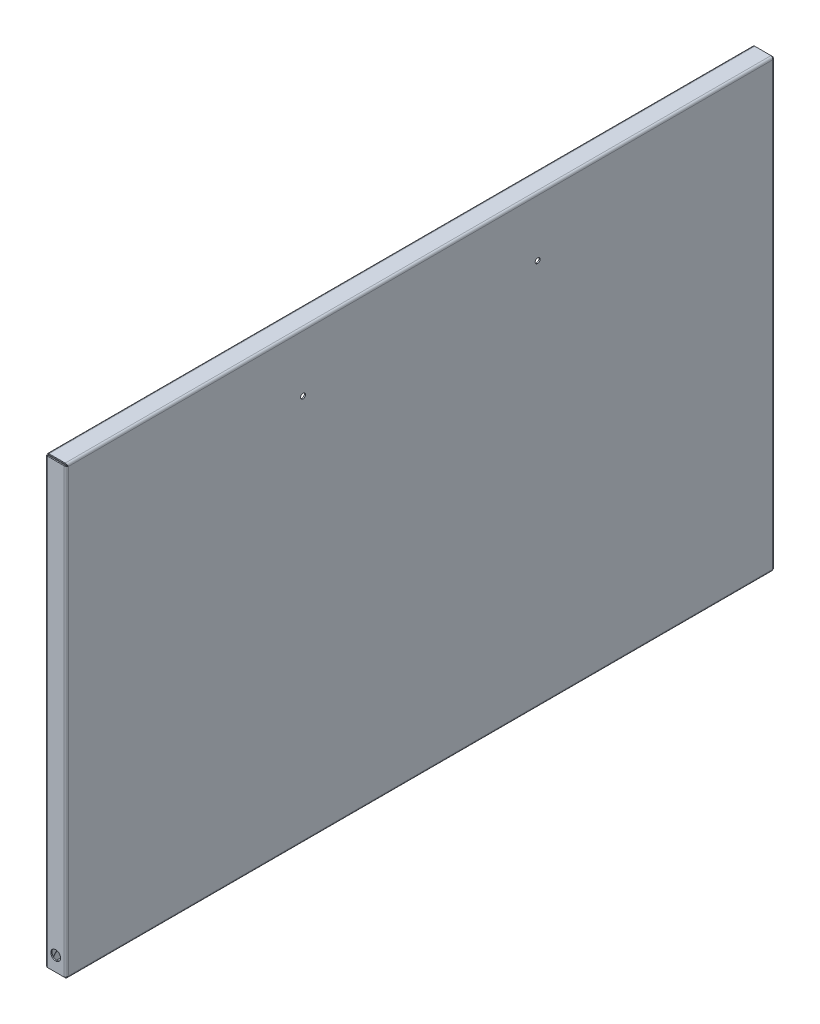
ISO-10303-21;
HEADER;
FILE_DESCRIPTION(('STEP AP214'),'2;1');
FILE_NAME('part.step','',(''),(''),'','','');
FILE_SCHEMA(('AUTOMOTIVE_DESIGN { 1 0 10303 214 1 1 1 1 }'));
ENDSEC;
DATA;
#1=APPLICATION_CONTEXT('core data for automotive mechanical design processes');
#2=APPLICATION_PROTOCOL_DEFINITION('international standard','automotive_design',2000,#1);
#3=PRODUCT_CONTEXT('',#1,'mechanical');
#4=PRODUCT('Part','Part','',(#3));
#5=PRODUCT_RELATED_PRODUCT_CATEGORY('part','',(#4));
#6=PRODUCT_DEFINITION_FORMATION('','',#4);
#7=PRODUCT_DEFINITION_CONTEXT('part definition',#1,'design');
#8=PRODUCT_DEFINITION('design','',#6,#7);
#9=PRODUCT_DEFINITION_SHAPE('','',#8);
#10=(LENGTH_UNIT() NAMED_UNIT(*) SI_UNIT(.MILLI.,.METRE.));
#11=(NAMED_UNIT(*) PLANE_ANGLE_UNIT() SI_UNIT($,.RADIAN.));
#12=(NAMED_UNIT(*) SI_UNIT($,.STERADIAN.) SOLID_ANGLE_UNIT());
#13=UNCERTAINTY_MEASURE_WITH_UNIT(LENGTH_MEASURE(1.E-05),#10,'distance_accuracy_value','');
#14=(GEOMETRIC_REPRESENTATION_CONTEXT(3) GLOBAL_UNCERTAINTY_ASSIGNED_CONTEXT((#13)) GLOBAL_UNIT_ASSIGNED_CONTEXT((#10,
#11,#12)) REPRESENTATION_CONTEXT('',''));
#15=CARTESIAN_POINT('',(0.,0.,0.));
#16=DIRECTION('',(0.,0.,1.));
#17=DIRECTION('',(1.,0.,0.));
#18=AXIS2_PLACEMENT_3D('',#15,#16,#17);
#19=CARTESIAN_POINT('',(0.,-289.56,460.375));
#20=DIRECTION('',(-1.,0.,0.));
#21=DIRECTION('',(0.,0.,1.));
#22=AXIS2_PLACEMENT_3D('',#19,#20,#21);
#23=PLANE('',#22);
#24=CARTESIAN_POINT('',(0.,-38.1,153.987500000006));
#25=DIRECTION('',(1.,0.,0.));
#26=DIRECTION('',(0.,0.,1.));
#27=AXIS2_PLACEMENT_3D('',#24,#25,#26);
#28=CIRCLE('',#27,1.58750000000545);
#29=CARTESIAN_POINT('',(0.,-38.1,155.575000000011));
#30=VERTEX_POINT('',#29);
#31=EDGE_CURVE('E1609',#30,#30,#28,.T.);
#32=ORIENTED_EDGE('',*,*,#31,.T.);
#33=EDGE_LOOP('',(#32));
#34=FACE_BOUND('',#33,.T.);
#35=CARTESIAN_POINT('',(0.,-38.1,306.387500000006));
#36=DIRECTION('',(1.,0.,0.));
#37=DIRECTION('',(0.,0.,-1.));
#38=AXIS2_PLACEMENT_3D('',#35,#36,#37);
#39=CIRCLE('',#38,1.58750000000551);
#40=CARTESIAN_POINT('',(0.,-38.1,304.8));
#41=VERTEX_POINT('',#40);
#42=EDGE_CURVE('E1551',#41,#41,#39,.T.);
#43=ORIENTED_EDGE('',*,*,#42,.T.);
#44=EDGE_LOOP('',(#43));
#45=FACE_BOUND('',#44,.T.);
#46=DIRECTION('',(0.,0.,1.));
#47=VECTOR('',#46,1.);
#48=CARTESIAN_POINT('',(0.,-1.4732,-2301.875));
#49=LINE('',#48,#47);
#50=CARTESIAN_POINT('',(0.,-1.47320000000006,1.47319999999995));
#51=VERTEX_POINT('',#50);
#52=CARTESIAN_POINT('',(0.,-1.47320000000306,458.9018));
#53=VERTEX_POINT('',#52);
#54=EDGE_CURVE('E69',#51,#53,#49,.T.);
#55=ORIENTED_EDGE('',*,*,#54,.F.);
#56=DIRECTION('',(0.,1.,0.));
#57=VECTOR('',#56,1.);
#58=CARTESIAN_POINT('',(0.,-289.56,1.4732));
#59=LINE('',#58,#57);
#60=CARTESIAN_POINT('',(0.,-288.086799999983,1.47319999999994));
#61=VERTEX_POINT('',#60);
#62=EDGE_CURVE('E303',#61,#51,#59,.T.);
#63=ORIENTED_EDGE('',*,*,#62,.F.);
#64=DIRECTION('',(0.,0.,-1.));
#65=VECTOR('',#64,1.);
#66=CARTESIAN_POINT('',(0.,-288.0868,460.375));
#67=LINE('',#66,#65);
#68=CARTESIAN_POINT('',(0.,-288.0868,458.901799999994));
#69=VERTEX_POINT('',#68);
#70=EDGE_CURVE('E296',#69,#61,#67,.T.);
#71=ORIENTED_EDGE('',*,*,#70,.F.);
#72=DIRECTION('',(0.,-1.,0.));
#73=VECTOR('',#72,1.);
#74=CARTESIAN_POINT('',(0.,-144.780000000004,458.901800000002));
#75=LINE('',#74,#73);
#76=EDGE_CURVE('E373',#53,#69,#75,.T.);
#77=ORIENTED_EDGE('',*,*,#76,.F.);
#78=EDGE_LOOP('',(#55,#63,#71,#77));
#79=FACE_BOUND('',#78,.T.);
#80=ADVANCED_FACE('F45',(#34,#45,#79),#23,.T.);
#81=CARTESIAN_POINT('',(0.7366,-289.56,460.375));
#82=DIRECTION('',(-1.,0.,0.));
#83=DIRECTION('',(0.,0.,1.));
#84=AXIS2_PLACEMENT_3D('',#81,#82,#83);
#85=PLANE('',#84);
#86=CARTESIAN_POINT('',(0.7366,-38.1,153.987500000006));
#87=DIRECTION('',(1.,0.,0.));
#88=DIRECTION('',(0.,0.,1.));
#89=AXIS2_PLACEMENT_3D('',#86,#87,#88);
#90=CIRCLE('',#89,1.58750000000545);
#91=CARTESIAN_POINT('',(0.7366,-38.1,155.575000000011));
#92=VERTEX_POINT('',#91);
#93=EDGE_CURVE('E1612',#92,#92,#90,.T.);
#94=ORIENTED_EDGE('',*,*,#93,.F.);
#95=EDGE_LOOP('',(#94));
#96=FACE_BOUND('',#95,.T.);
#97=CARTESIAN_POINT('',(0.7366,-38.1,306.387500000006));
#98=DIRECTION('',(1.,0.,0.));
#99=DIRECTION('',(0.,0.,-1.));
#100=AXIS2_PLACEMENT_3D('',#97,#98,#99);
#101=CIRCLE('',#100,1.58750000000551);
#102=CARTESIAN_POINT('',(0.7366,-38.1,304.8));
#103=VERTEX_POINT('',#102);
#104=EDGE_CURVE('E1606',#103,#103,#101,.T.);
#105=ORIENTED_EDGE('',*,*,#104,.F.);
#106=EDGE_LOOP('',(#105));
#107=FACE_BOUND('',#106,.T.);
#108=DIRECTION('',(0.,1.,0.));
#109=VECTOR('',#108,1.);
#110=CARTESIAN_POINT('',(0.7366,-289.56,1.4732));
#111=LINE('',#110,#109);
#112=CARTESIAN_POINT('',(0.7366,-288.0868,1.4732));
#113=VERTEX_POINT('',#112);
#114=CARTESIAN_POINT('',(0.7366,-1.4732,1.4732000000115));
#115=VERTEX_POINT('',#114);
#116=EDGE_CURVE('E587',#113,#115,#111,.T.);
#117=ORIENTED_EDGE('',*,*,#116,.T.);
#118=DIRECTION('',(0.,0.,1.));
#119=VECTOR('',#118,1.);
#120=CARTESIAN_POINT('',(0.7366,-1.4732,-2301.875));
#121=LINE('',#120,#119);
#122=CARTESIAN_POINT('',(0.7366,-1.47320000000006,458.9018));
#123=VERTEX_POINT('',#122);
#124=EDGE_CURVE('E61',#115,#123,#121,.T.);
#125=ORIENTED_EDGE('',*,*,#124,.T.);
#126=DIRECTION('',(0.,-1.,0.));
#127=VECTOR('',#126,1.);
#128=CARTESIAN_POINT('',(0.7366,0.,458.9018));
#129=LINE('',#128,#127);
#130=CARTESIAN_POINT('',(0.7366,-288.0868,458.9018));
#131=VERTEX_POINT('',#130);
#132=EDGE_CURVE('E421',#123,#131,#129,.T.);
#133=ORIENTED_EDGE('',*,*,#132,.T.);
#134=DIRECTION('',(0.,0.,-1.));
#135=VECTOR('',#134,1.);
#136=CARTESIAN_POINT('',(0.7366,-288.0868,460.375));
#137=LINE('',#136,#135);
#138=EDGE_CURVE('E323',#131,#113,#137,.T.);
#139=ORIENTED_EDGE('',*,*,#138,.T.);
#140=EDGE_LOOP('',(#117,#125,#133,#139));
#141=FACE_BOUND('',#140,.T.);
#142=ADVANCED_FACE('F47',(#96,#107,#141),#85,.F.);
#143=CARTESIAN_POINT('',(-11.2268,0.,0.916205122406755));
#144=DIRECTION('',(0.,0.,-1.));
#145=DIRECTION('',(1.,0.,0.));
#146=AXIS2_PLACEMENT_3D('',#143,#144,#145);
#147=PLANE('',#146);
#148=DIRECTION('',(0.,1.,0.));
#149=VECTOR('',#148,1.);
#150=CARTESIAN_POINT('',(-0.7366,0.,0.91620512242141));
#151=LINE('',#150,#149);
#152=CARTESIAN_POINT('',(-0.7366,0.,0.91620512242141));
#153=VERTEX_POINT('',#152);
#154=CARTESIAN_POINT('',(-0.7366,-0.7366,0.91620512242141));
#155=VERTEX_POINT('',#154);
#156=EDGE_CURVE('E11',#153,#155,#151,.F.);
#157=ORIENTED_EDGE('',*,*,#156,.T.);
#158=DIRECTION('',(1.,0.,0.));
#159=VECTOR('',#158,1.);
#160=CARTESIAN_POINT('',(-11.2268,-0.7366,0.916205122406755));
#161=LINE('',#160,#159);
#162=CARTESIAN_POINT('',(-11.2268,-0.7366,0.916205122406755));
#163=VERTEX_POINT('',#162);
#164=EDGE_CURVE('E470',#163,#155,#161,.T.);
#165=ORIENTED_EDGE('',*,*,#164,.F.);
#166=DIRECTION('',(0.,1.,0.));
#167=VECTOR('',#166,1.);
#168=CARTESIAN_POINT('',(-11.2268,0.,0.916205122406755));
#169=LINE('',#168,#167);
#170=CARTESIAN_POINT('',(-11.2268,0.,0.916205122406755));
#171=VERTEX_POINT('',#170);
#172=EDGE_CURVE('E54',#171,#163,#169,.F.);
#173=ORIENTED_EDGE('',*,*,#172,.F.);
#174=DIRECTION('',(1.,0.,0.));
#175=VECTOR('',#174,1.);
#176=CARTESIAN_POINT('',(-11.2268,0.,0.916205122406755));
#177=LINE('',#176,#175);
#178=EDGE_CURVE('E494',#171,#153,#177,.T.);
#179=ORIENTED_EDGE('',*,*,#178,.T.);
#180=EDGE_LOOP('',(#157,#165,#173,#179));
#181=FACE_BOUND('',#180,.T.);
#182=ADVANCED_FACE('F532',(#181),#147,.T.);
#183=CARTESIAN_POINT('',(-11.2268,-2.9464,2.38940512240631));
#184=CARTESIAN_POINT('',(-11.2268,-2.70086666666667,2.3894051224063));
#185=CARTESIAN_POINT('',(-11.2268,-2.45533333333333,2.3894051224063));
#186=CARTESIAN_POINT('',(-11.2268,-2.2098,2.38940512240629));
#187=CARTESIAN_POINT('',(-8.2804,-2.9464,2.38940512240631));
#188=CARTESIAN_POINT('',(-8.77146666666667,-2.70086666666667,2.3894051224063));
#189=CARTESIAN_POINT('',(-9.26253333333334,-2.45533333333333,2.3894051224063));
#190=CARTESIAN_POINT('',(-9.7536,-2.2098,2.38940512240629));
#191=CARTESIAN_POINT('',(-8.2804,0.,0.916205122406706));
#192=CARTESIAN_POINT('',(-8.77146666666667,-0.245533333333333,0.916205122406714));
#193=CARTESIAN_POINT('',(-9.26253333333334,-0.491066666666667,0.916205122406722));
#194=CARTESIAN_POINT('',(-9.7536,-0.7366,0.91620512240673));
#195=CARTESIAN_POINT('',(-11.2268,0.,0.916205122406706));
#196=CARTESIAN_POINT('',(-11.2268,-0.245533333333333,0.916205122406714));
#197=CARTESIAN_POINT('',(-11.2268,-0.491066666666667,0.916205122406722));
#198=CARTESIAN_POINT('',(-11.2268,-0.7366,0.91620512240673));
#199=CARTESIAN_POINT('',(-14.1732,0.,0.916205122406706));
#200=CARTESIAN_POINT('',(-13.6821333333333,-0.245533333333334,0.916205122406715));
#201=CARTESIAN_POINT('',(-13.1910666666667,-0.491066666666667,0.916205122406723));
#202=CARTESIAN_POINT('',(-12.7,-0.7366,0.916205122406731));
#203=CARTESIAN_POINT('',(-14.1732,-2.9464,2.38940512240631));
#204=CARTESIAN_POINT('',(-13.6821333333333,-2.70086666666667,2.3894051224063));
#205=CARTESIAN_POINT('',(-13.1910666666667,-2.45533333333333,2.3894051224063));
#206=CARTESIAN_POINT('',(-12.7,-2.2098,2.38940512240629));
#207=CARTESIAN_POINT('',(-11.2268,-2.9464,2.38940512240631));
#208=CARTESIAN_POINT('',(-11.2268,-2.70086666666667,2.3894051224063));
#209=CARTESIAN_POINT('',(-11.2268,-2.45533333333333,2.3894051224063));
#210=CARTESIAN_POINT('',(-11.2268,-2.2098,2.38940512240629));
#211=(BOUNDED_SURFACE() B_SPLINE_SURFACE(3,3,((#183,#184,#185,#186),(#187,#188,#189,#190),(#191,
#192,#193,#194),(#195,#196,#197,#198),(#199,#200,#201,#202),(#203,#204,#205,#206),(#207,#208,
#209,#210)),.UNSPECIFIED.,.T.,.F.,.F.) B_SPLINE_SURFACE_WITH_KNOTS((4,3,4),(4,4),(0.,0.5,1.),
(0.,1.),.UNSPECIFIED.) GEOMETRIC_REPRESENTATION_ITEM() RATIONAL_B_SPLINE_SURFACE(((1.,1.,1.,1.),
(0.333333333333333,0.333333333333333,0.333333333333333,0.333333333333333),(0.333333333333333,
0.333333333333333,0.333333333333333,0.333333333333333),(1.,1.,1.,1.),(0.333333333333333,
0.333333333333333,0.333333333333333,0.333333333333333),(0.333333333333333,0.333333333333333,
0.333333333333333,0.333333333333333),(1.,1.,1.,1.))) REPRESENTATION_ITEM('') SURFACE());
#212=CARTESIAN_POINT('',(-11.2268,-1.4732,1.65280512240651));
#213=DIRECTION('',(0.,-0.707106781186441,-0.707106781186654));
#214=DIRECTION('',(0.,-0.707106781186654,0.707106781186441));
#215=AXIS2_PLACEMENT_3D('',#212,#213,#214);
#216=ELLIPSE('',#215,1.04170971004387,0.7366);
#217=CARTESIAN_POINT('',(-11.9634,-1.47319999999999,1.65280512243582));
#218=VERTEX_POINT('',#217);
#219=EDGE_CURVE('E476',#163,#218,#216,.F.);
#220=DIRECTION('',(-1.,0.,0.));
#221=VECTOR('',#220,1.);
#222=CARTESIAN_POINT('',(-12.7,-1.47319999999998,1.65280512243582));
#223=LINE('',#222,#221);
#224=CARTESIAN_POINT('',(-12.7,-1.47319999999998,1.65280512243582));
#225=VERTEX_POINT('',#224);
#226=EDGE_CURVE('E519',#225,#218,#223,.F.);
#227=CARTESIAN_POINT('',(-11.2268,-1.4732,1.65280512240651));
#228=DIRECTION('',(0.,-0.447213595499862,-0.894427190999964));
#229=DIRECTION('',(0.,-0.894427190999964,0.447213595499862));
#230=AXIS2_PLACEMENT_3D('',#227,#228,#229);
#231=ELLIPSE('',#230,1.64708767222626,1.4732);
#232=EDGE_CURVE('E500',#171,#225,#231,.F.);
#233=ORIENTED_EDGE('',*,*,#172,.T.);
#234=ORIENTED_EDGE('',*,*,#219,.T.);
#235=ORIENTED_EDGE('',*,*,#226,.F.);
#236=ORIENTED_EDGE('',*,*,#232,.F.);
#237=EDGE_LOOP('',(#233,#234,#235,#236));
#238=FACE_BOUND('',#237,.T.);
#239=ADVANCED_FACE('F527',(#238),#211,.F.);
#240=CARTESIAN_POINT('',(-12.6999999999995,1151.02730256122,-1150.84769743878));
#241=DIRECTION('',(0.,-0.707106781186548,-0.707106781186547));
#242=DIRECTION('',(0.,-0.707106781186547,0.707106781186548));
#243=AXIS2_PLACEMENT_3D('',#240,#241,#242);
#244=PLANE('',#243);
#245=ORIENTED_EDGE('',*,*,#226,.T.);
#246=DIRECTION('',(0.,-0.707106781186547,0.707106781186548));
#247=VECTOR('',#246,1.);
#248=CARTESIAN_POINT('',(-11.9633999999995,1151.02730256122,-1150.84769743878));
#249=LINE('',#248,#247);
#250=CARTESIAN_POINT('',(-11.9634,-7.61999999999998,7.79960512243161));
#251=VERTEX_POINT('',#250);
#252=EDGE_CURVE('E473',#218,#251,#249,.T.);
#253=ORIENTED_EDGE('',*,*,#252,.T.);
#254=DIRECTION('',(-1.,0.,0.));
#255=VECTOR('',#254,1.);
#256=CARTESIAN_POINT('',(-12.7,-7.61999999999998,7.7996051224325));
#257=LINE('',#256,#255);
#258=CARTESIAN_POINT('',(-12.7,-7.61999999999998,7.7996051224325));
#259=VERTEX_POINT('',#258);
#260=EDGE_CURVE('E516',#259,#251,#257,.F.);
#261=ORIENTED_EDGE('',*,*,#260,.F.);
#262=DIRECTION('',(0.,-0.707106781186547,0.707106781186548));
#263=VECTOR('',#262,1.);
#264=CARTESIAN_POINT('',(-12.6999999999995,1151.02730256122,-1150.84769743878));
#265=LINE('',#264,#263);
#266=EDGE_CURVE('E497',#225,#259,#265,.T.);
#267=ORIENTED_EDGE('',*,*,#266,.F.);
#268=EDGE_LOOP('',(#245,#253,#261,#267));
#269=FACE_BOUND('',#268,.T.);
#270=ADVANCED_FACE('F547',(#269),#244,.T.);
#271=CARTESIAN_POINT('',(-12.7,-7.61999999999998,-2301.875));
#272=DIRECTION('',(0.,-1.,0.));
#273=DIRECTION('',(0.,0.,1.));
#274=AXIS2_PLACEMENT_3D('',#271,#272,#273);
#275=PLANE('',#274);
#276=ORIENTED_EDGE('',*,*,#260,.T.);
#277=DIRECTION('',(0.,0.,1.));
#278=VECTOR('',#277,1.);
#279=CARTESIAN_POINT('',(-11.9634,-7.61999999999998,-2301.875));
#280=LINE('',#279,#278);
#281=CARTESIAN_POINT('',(-11.9634,-7.61999999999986,452.575394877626));
#282=VERTEX_POINT('',#281);
#283=EDGE_CURVE('E457',#251,#282,#280,.T.);
#284=ORIENTED_EDGE('',*,*,#283,.T.);
#285=DIRECTION('',(-1.,0.,0.));
#286=VECTOR('',#285,1.);
#287=CARTESIAN_POINT('',(-12.7,-7.61999999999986,452.575394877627));
#288=LINE('',#287,#286);
#289=CARTESIAN_POINT('',(-12.7,-7.61999999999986,452.575394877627));
#290=VERTEX_POINT('',#289);
#291=EDGE_CURVE('E513',#290,#282,#288,.F.);
#292=ORIENTED_EDGE('',*,*,#291,.F.);
#293=DIRECTION('',(0.,0.,1.));
#294=VECTOR('',#293,1.);
#295=CARTESIAN_POINT('',(-12.7,-7.61999999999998,-2301.875));
#296=LINE('',#295,#294);
#297=EDGE_CURVE('E484',#259,#290,#296,.T.);
#298=ORIENTED_EDGE('',*,*,#297,.F.);
#299=EDGE_LOOP('',(#276,#284,#292,#298));
#300=FACE_BOUND('',#299,.T.);
#301=ADVANCED_FACE('F771',(#300),#275,.T.);
#302=CARTESIAN_POINT('',(-12.7000000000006,-1381.03519743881,-920.839802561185));
#303=DIRECTION('',(0.,-0.707106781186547,0.707106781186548));
#304=DIRECTION('',(0.,0.707106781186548,0.707106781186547));
#305=AXIS2_PLACEMENT_3D('',#302,#303,#304);
#306=PLANE('',#305);
#307=ORIENTED_EDGE('',*,*,#291,.T.);
#308=DIRECTION('',(0.,0.707106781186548,0.707106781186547));
#309=VECTOR('',#308,1.);
#310=CARTESIAN_POINT('',(-11.9634000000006,-1381.03519743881,-920.839802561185));
#311=LINE('',#310,#309);
#312=CARTESIAN_POINT('',(-11.9634,-1.47319999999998,458.722194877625));
#313=VERTEX_POINT('',#312);
#314=EDGE_CURVE('E467',#282,#313,#311,.T.);
#315=ORIENTED_EDGE('',*,*,#314,.T.);
#316=DIRECTION('',(-1.,0.,0.));
#317=VECTOR('',#316,1.);
#318=CARTESIAN_POINT('',(-12.7,-1.47319999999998,458.722194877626));
#319=LINE('',#318,#317);
#320=CARTESIAN_POINT('',(-12.7,-1.47319999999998,458.722194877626));
#321=VERTEX_POINT('',#320);
#322=EDGE_CURVE('E510',#321,#313,#319,.F.);
#323=ORIENTED_EDGE('',*,*,#322,.F.);
#324=DIRECTION('',(0.,0.707106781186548,0.707106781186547));
#325=VECTOR('',#324,1.);
#326=CARTESIAN_POINT('',(-12.7000000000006,-1381.03519743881,-920.839802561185));
#327=LINE('',#326,#325);
#328=EDGE_CURVE('E491',#290,#321,#327,.T.);
#329=ORIENTED_EDGE('',*,*,#328,.F.);
#330=EDGE_LOOP('',(#307,#315,#323,#329));
#331=FACE_BOUND('',#330,.T.);
#332=ADVANCED_FACE('F774',(#331),#306,.T.);
#333=CARTESIAN_POINT('',(-11.2268,0.,459.458794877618));
#334=CARTESIAN_POINT('',(-11.2268,-0.245533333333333,459.458794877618));
#335=CARTESIAN_POINT('',(-11.2268,-0.491066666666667,459.458794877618));
#336=CARTESIAN_POINT('',(-11.2268,-0.7366,459.458794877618));
#337=CARTESIAN_POINT('',(-8.2804,0.,459.458794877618));
#338=CARTESIAN_POINT('',(-8.77146666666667,-0.245533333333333,459.458794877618));
#339=CARTESIAN_POINT('',(-9.26253333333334,-0.491066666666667,459.458794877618));
#340=CARTESIAN_POINT('',(-9.7536,-0.7366,459.458794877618));
#341=CARTESIAN_POINT('',(-8.2804,-2.9464,457.985594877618));
#342=CARTESIAN_POINT('',(-8.77146666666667,-2.70086666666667,457.985594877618));
#343=CARTESIAN_POINT('',(-9.26253333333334,-2.45533333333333,457.985594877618));
#344=CARTESIAN_POINT('',(-9.7536,-2.2098,457.985594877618));
#345=CARTESIAN_POINT('',(-11.2268,-2.9464,457.985594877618));
#346=CARTESIAN_POINT('',(-11.2268,-2.70086666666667,457.985594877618));
#347=CARTESIAN_POINT('',(-11.2268,-2.45533333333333,457.985594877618));
#348=CARTESIAN_POINT('',(-11.2268,-2.2098,457.985594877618));
#349=CARTESIAN_POINT('',(-14.1732,-2.9464,457.985594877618));
#350=CARTESIAN_POINT('',(-13.6821333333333,-2.70086666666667,457.985594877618));
#351=CARTESIAN_POINT('',(-13.1910666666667,-2.45533333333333,457.985594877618));
#352=CARTESIAN_POINT('',(-12.7,-2.2098,457.985594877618));
#353=CARTESIAN_POINT('',(-14.1732,0.,459.458794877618));
#354=CARTESIAN_POINT('',(-13.6821333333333,-0.245533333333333,459.458794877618));
#355=CARTESIAN_POINT('',(-13.1910666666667,-0.491066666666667,459.458794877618));
#356=CARTESIAN_POINT('',(-12.7,-0.7366,459.458794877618));
#357=CARTESIAN_POINT('',(-11.2268,0.,459.458794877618));
#358=CARTESIAN_POINT('',(-11.2268,-0.245533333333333,459.458794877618));
#359=CARTESIAN_POINT('',(-11.2268,-0.491066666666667,459.458794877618));
#360=CARTESIAN_POINT('',(-11.2268,-0.7366,459.458794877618));
#361=(BOUNDED_SURFACE() B_SPLINE_SURFACE(3,3,((#333,#334,#335,#336),(#337,#338,#339,#340),(#341,
#342,#343,#344),(#345,#346,#347,#348),(#349,#350,#351,#352),(#353,#354,#355,#356),(#357,#358,
#359,#360)),.UNSPECIFIED.,.T.,.F.,.F.) B_SPLINE_SURFACE_WITH_KNOTS((4,3,4),(4,4),(0.,0.5,1.),
(0.,1.),.UNSPECIFIED.) GEOMETRIC_REPRESENTATION_ITEM() RATIONAL_B_SPLINE_SURFACE(((1.,1.,1.,1.),
(0.333333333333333,0.333333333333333,0.333333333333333,0.333333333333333),(0.333333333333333,
0.333333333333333,0.333333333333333,0.333333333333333),(1.,1.,1.,1.),(0.333333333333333,
0.333333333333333,0.333333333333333,0.333333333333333),(0.333333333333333,0.333333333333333,
0.333333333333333,0.333333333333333),(1.,1.,1.,1.))) REPRESENTATION_ITEM('') SURFACE());
#362=CARTESIAN_POINT('',(-11.2268,-1.4732,458.722194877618));
#363=DIRECTION('',(0.,-0.707106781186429,0.707106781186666));
#364=DIRECTION('',(0.,0.707106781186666,0.707106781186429));
#365=AXIS2_PLACEMENT_3D('',#362,#363,#364);
#366=ELLIPSE('',#365,1.04170971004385,0.7366);
#367=CARTESIAN_POINT('',(-11.2268,-0.7366,459.458794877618));
#368=VERTEX_POINT('',#367);
#369=EDGE_CURVE('E464',#313,#368,#366,.F.);
#370=DIRECTION('',(0.,1.,0.));
#371=VECTOR('',#370,1.);
#372=CARTESIAN_POINT('',(-11.2268,0.,459.458794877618));
#373=LINE('',#372,#371);
#374=CARTESIAN_POINT('',(-11.2268,0.,459.458794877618));
#375=VERTEX_POINT('',#374);
#376=EDGE_CURVE('E507',#375,#368,#373,.F.);
#377=CARTESIAN_POINT('',(-11.2268,-1.4732,458.722194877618));
#378=DIRECTION('',(0.,-0.447213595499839,0.894427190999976));
#379=DIRECTION('',(0.,0.894427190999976,0.447213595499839));
#380=AXIS2_PLACEMENT_3D('',#377,#378,#379);
#381=ELLIPSE('',#380,1.64708767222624,1.4732);
#382=EDGE_CURVE('E488',#321,#375,#381,.F.);
#383=ORIENTED_EDGE('',*,*,#322,.T.);
#384=ORIENTED_EDGE('',*,*,#369,.T.);
#385=ORIENTED_EDGE('',*,*,#376,.F.);
#386=ORIENTED_EDGE('',*,*,#382,.F.);
#387=EDGE_LOOP('',(#383,#384,#385,#386));
#388=FACE_BOUND('',#387,.T.);
#389=ADVANCED_FACE('F778',(#388),#361,.F.);
#390=CARTESIAN_POINT('',(-11.2268,0.,459.458794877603));
#391=DIRECTION('',(0.,0.,-1.));
#392=DIRECTION('',(1.,0.,0.));
#393=AXIS2_PLACEMENT_3D('',#390,#391,#392);
#394=PLANE('',#393);
#395=ORIENTED_EDGE('',*,*,#376,.T.);
#396=DIRECTION('',(1.,0.,0.));
#397=VECTOR('',#396,1.);
#398=CARTESIAN_POINT('',(-11.2268,-0.7366,459.458794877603));
#399=LINE('',#398,#397);
#400=CARTESIAN_POINT('',(-0.7366,-0.7366,459.458794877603));
#401=VERTEX_POINT('',#400);
#402=EDGE_CURVE('E461',#401,#368,#399,.F.);
#403=ORIENTED_EDGE('',*,*,#402,.F.);
#404=DIRECTION('',(0.,1.,0.));
#405=VECTOR('',#404,1.);
#406=CARTESIAN_POINT('',(-0.7366,0.,459.458794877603));
#407=LINE('',#406,#405);
#408=CARTESIAN_POINT('',(-0.7366,0.,459.458794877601));
#409=VERTEX_POINT('',#408);
#410=EDGE_CURVE('E49',#409,#401,#407,.F.);
#411=ORIENTED_EDGE('',*,*,#410,.F.);
#412=DIRECTION('',(1.,0.,0.));
#413=VECTOR('',#412,1.);
#414=CARTESIAN_POINT('',(-11.2268,0.,459.458794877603));
#415=LINE('',#414,#413);
#416=EDGE_CURVE('E460',#409,#375,#415,.F.);
#417=ORIENTED_EDGE('',*,*,#416,.T.);
#418=EDGE_LOOP('',(#395,#403,#411,#417));
#419=FACE_BOUND('',#418,.T.);
#420=ADVANCED_FACE('F557',(#419),#394,.F.);
#421=CARTESIAN_POINT('',(-11.2268,-0.7366,-2301.875));
#422=DIRECTION('',(0.,-1.,0.));
#423=DIRECTION('',(0.,0.,-1.));
#424=AXIS2_PLACEMENT_3D('',#421,#422,#423);
#425=PLANE('',#424);
#426=ORIENTED_EDGE('',*,*,#402,.T.);
#427=DIRECTION('',(0.,0.,-1.));
#428=VECTOR('',#427,1.);
#429=CARTESIAN_POINT('',(-11.2268,-0.7366,-2301.875));
#430=LINE('',#429,#428);
#431=EDGE_CURVE('E454',#163,#368,#430,.F.);
#432=ORIENTED_EDGE('',*,*,#431,.F.);
#433=ORIENTED_EDGE('',*,*,#164,.T.);
#434=DIRECTION('',(0.,0.,-1.));
#435=VECTOR('',#434,1.);
#436=CARTESIAN_POINT('',(-0.7366,-0.7366,-2301.875));
#437=LINE('',#436,#435);
#438=EDGE_CURVE('E456',#155,#401,#437,.F.);
#439=ORIENTED_EDGE('',*,*,#438,.T.);
#440=EDGE_LOOP('',(#426,#432,#433,#439));
#441=FACE_BOUND('',#440,.T.);
#442=ADVANCED_FACE('F536',(#441),#425,.T.);
#443=CARTESIAN_POINT('',(-11.2268,-1.4732,-2301.875));
#444=DIRECTION('',(0.,0.,1.));
#445=DIRECTION('',(1.,0.,0.));
#446=AXIS2_PLACEMENT_3D('',#443,#444,#445);
#447=CYLINDRICAL_SURFACE('',#446,0.7366);
#448=DIRECTION('',(0.,0.,1.));
#449=VECTOR('',#448,1.);
#450=CARTESIAN_POINT('',(-11.9634,-1.4732,-2301.875));
#451=LINE('',#450,#449);
#452=EDGE_CURVE('E458',#218,#313,#451,.T.);
#453=ORIENTED_EDGE('',*,*,#452,.F.);
#454=ORIENTED_EDGE('',*,*,#219,.F.);
#455=ORIENTED_EDGE('',*,*,#431,.T.);
#456=ORIENTED_EDGE('',*,*,#369,.F.);
#457=EDGE_LOOP('',(#453,#454,#455,#456));
#458=FACE_BOUND('',#457,.T.);
#459=ADVANCED_FACE('F540',(#458),#447,.F.);
#460=CARTESIAN_POINT('',(-11.9634,0.,-2301.875));
#461=DIRECTION('',(-1.,0.,0.));
#462=DIRECTION('',(0.,-1.,0.));
#463=AXIS2_PLACEMENT_3D('',#460,#461,#462);
#464=PLANE('',#463);
#465=ORIENTED_EDGE('',*,*,#283,.F.);
#466=ORIENTED_EDGE('',*,*,#252,.F.);
#467=ORIENTED_EDGE('',*,*,#452,.T.);
#468=ORIENTED_EDGE('',*,*,#314,.F.);
#469=EDGE_LOOP('',(#465,#466,#467,#468));
#470=FACE_BOUND('',#469,.T.);
#471=ADVANCED_FACE('F543',(#470),#464,.F.);
#472=CARTESIAN_POINT('',(-11.2268,0.,-2301.875));
#473=DIRECTION('',(0.,-1.,0.));
#474=DIRECTION('',(0.,0.,-1.));
#475=AXIS2_PLACEMENT_3D('',#472,#473,#474);
#476=PLANE('',#475);
#477=ORIENTED_EDGE('',*,*,#416,.F.);
#478=DIRECTION('',(0.,0.,-1.));
#479=VECTOR('',#478,1.);
#480=CARTESIAN_POINT('',(-0.7366,0.,-2301.875));
#481=LINE('',#480,#479);
#482=EDGE_CURVE('E483',#153,#409,#481,.F.);
#483=ORIENTED_EDGE('',*,*,#482,.F.);
#484=ORIENTED_EDGE('',*,*,#178,.F.);
#485=DIRECTION('',(0.,0.,-1.));
#486=VECTOR('',#485,1.);
#487=CARTESIAN_POINT('',(-11.2268,0.,-2301.875));
#488=LINE('',#487,#486);
#489=EDGE_CURVE('E481',#171,#375,#488,.F.);
#490=ORIENTED_EDGE('',*,*,#489,.T.);
#491=EDGE_LOOP('',(#477,#483,#484,#490));
#492=FACE_BOUND('',#491,.T.);
#493=ADVANCED_FACE('F555',(#492),#476,.F.);
#494=CARTESIAN_POINT('',(-11.2268,-1.4732,-2301.875));
#495=DIRECTION('',(0.,0.,1.));
#496=DIRECTION('',(1.,0.,0.));
#497=AXIS2_PLACEMENT_3D('',#494,#495,#496);
#498=CYLINDRICAL_SURFACE('',#497,1.4732);
#499=DIRECTION('',(0.,0.,1.));
#500=VECTOR('',#499,1.);
#501=CARTESIAN_POINT('',(-12.7,-1.4732,-2301.875));
#502=LINE('',#501,#500);
#503=EDGE_CURVE('E451',#225,#321,#502,.T.);
#504=ORIENTED_EDGE('',*,*,#503,.T.);
#505=ORIENTED_EDGE('',*,*,#382,.T.);
#506=ORIENTED_EDGE('',*,*,#489,.F.);
#507=ORIENTED_EDGE('',*,*,#232,.T.);
#508=EDGE_LOOP('',(#504,#505,#506,#507));
#509=FACE_BOUND('',#508,.T.);
#510=ADVANCED_FACE('F550',(#509),#498,.T.);
#511=CARTESIAN_POINT('',(-12.7,0.,-2301.875));
#512=DIRECTION('',(-1.,0.,0.));
#513=DIRECTION('',(0.,-1.,0.));
#514=AXIS2_PLACEMENT_3D('',#511,#512,#513);
#515=PLANE('',#514);
#516=ORIENTED_EDGE('',*,*,#297,.T.);
#517=ORIENTED_EDGE('',*,*,#328,.T.);
#518=ORIENTED_EDGE('',*,*,#503,.F.);
#519=ORIENTED_EDGE('',*,*,#266,.T.);
#520=EDGE_LOOP('',(#516,#517,#518,#519));
#521=FACE_BOUND('',#520,.T.);
#522=ADVANCED_FACE('F792',(#521),#515,.T.);
#523=CARTESIAN_POINT('',(-0.7366,-2.2098,2.03019487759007));
#524=CARTESIAN_POINT('',(-0.7366,-2.45533333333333,2.03019487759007));
#525=CARTESIAN_POINT('',(-0.736600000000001,-2.70086666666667,2.03019487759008));
#526=CARTESIAN_POINT('',(-0.736600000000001,-2.9464,2.03019487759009));
#527=CARTESIAN_POINT('',(-2.2098,-2.2098,2.03019487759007));
#528=CARTESIAN_POINT('',(-2.70086666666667,-2.45533333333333,2.03019487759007));
#529=CARTESIAN_POINT('',(-3.19193333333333,-2.70086666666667,2.03019487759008));
#530=CARTESIAN_POINT('',(-3.683,-2.9464,2.03019487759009));
#531=CARTESIAN_POINT('',(-2.2098,-0.7366,0.916205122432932));
#532=CARTESIAN_POINT('',(-2.70086666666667,-0.491066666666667,0.916205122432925));
#533=CARTESIAN_POINT('',(-3.19193333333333,-0.245533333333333,0.916205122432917));
#534=CARTESIAN_POINT('',(-3.683,0.,0.916205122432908));
#535=CARTESIAN_POINT('',(-0.7366,-0.7366,0.916205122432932));
#536=CARTESIAN_POINT('',(-0.7366,-0.491066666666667,0.916205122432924));
#537=CARTESIAN_POINT('',(-0.7366,-0.245533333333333,0.916205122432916));
#538=CARTESIAN_POINT('',(-0.7366,0.,0.916205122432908));
#539=CARTESIAN_POINT('',(0.7366,-0.7366,0.916205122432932));
#540=CARTESIAN_POINT('',(1.22766666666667,-0.491066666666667,0.916205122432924));
#541=CARTESIAN_POINT('',(1.71873333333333,-0.245533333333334,0.916205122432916));
#542=CARTESIAN_POINT('',(2.2098,0.,0.916205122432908));
#543=CARTESIAN_POINT('',(0.736599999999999,-2.2098,2.03019487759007));
#544=CARTESIAN_POINT('',(1.22766666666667,-2.45533333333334,2.03019487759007));
#545=CARTESIAN_POINT('',(1.71873333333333,-2.70086666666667,2.03019487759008));
#546=CARTESIAN_POINT('',(2.2098,-2.9464,2.03019487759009));
#547=CARTESIAN_POINT('',(-0.7366,-2.2098,2.03019487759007));
#548=CARTESIAN_POINT('',(-0.7366,-2.45533333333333,2.03019487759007));
#549=CARTESIAN_POINT('',(-0.736600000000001,-2.70086666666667,2.03019487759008));
#550=CARTESIAN_POINT('',(-0.736600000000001,-2.9464,2.03019487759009));
#551=(BOUNDED_SURFACE() B_SPLINE_SURFACE(3,3,((#523,#524,#525,#526),(#527,#528,#529,#530),(#531,
#532,#533,#534),(#535,#536,#537,#538),(#539,#540,#541,#542),(#543,#544,#545,#546),(#547,#548,
#549,#550)),.UNSPECIFIED.,.T.,.F.,.F.) B_SPLINE_SURFACE_WITH_KNOTS((4,3,4),(4,4),(0.,0.5,1.),
(0.,1.),.UNSPECIFIED.) GEOMETRIC_REPRESENTATION_ITEM() RATIONAL_B_SPLINE_SURFACE(((1.,1.,1.,1.),
(0.333333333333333,0.333333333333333,0.333333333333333,0.333333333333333),(0.333333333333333,
0.333333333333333,0.333333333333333,0.333333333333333),(1.,1.,1.,1.),(0.333333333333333,
0.333333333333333,0.333333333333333,0.333333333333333),(0.333333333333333,0.333333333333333,
0.333333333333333,0.333333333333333),(1.,1.,1.,1.))) REPRESENTATION_ITEM('') SURFACE());
#552=DIRECTION('',(1.,0.,0.));
#553=VECTOR('',#552,1.);
#554=CARTESIAN_POINT('',(0.7366,-1.4732,1.4732000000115));
#555=LINE('',#554,#553);
#556=EDGE_CURVE('E448',#115,#51,#555,.F.);
#557=CARTESIAN_POINT('',(-0.7366,-1.4732,1.4732000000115));
#558=DIRECTION('',(0.,-0.603145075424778,-0.797631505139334));
#559=DIRECTION('',(0.,-0.797631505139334,0.603145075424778));
#560=AXIS2_PLACEMENT_3D('',#557,#558,#559);
#561=ELLIPSE('',#560,0.923484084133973,0.7366);
#562=EDGE_CURVE('E438',#155,#51,#561,.T.);
#563=CARTESIAN_POINT('',(-0.7366,-1.4732,1.4732000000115));
#564=DIRECTION('',(0.,-0.353652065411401,-0.93537704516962));
#565=DIRECTION('',(0.,-0.93537704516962,0.353652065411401));
#566=AXIS2_PLACEMENT_3D('',#563,#564,#565);
#567=ELLIPSE('',#566,1.57497985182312,1.4732);
#568=EDGE_CURVE('E443',#153,#115,#567,.T.);
#569=ORIENTED_EDGE('',*,*,#556,.T.);
#570=ORIENTED_EDGE('',*,*,#562,.F.);
#571=ORIENTED_EDGE('',*,*,#156,.F.);
#572=ORIENTED_EDGE('',*,*,#568,.T.);
#573=EDGE_LOOP('',(#569,#570,#571,#572));
#574=FACE_BOUND('',#573,.T.);
#575=ADVANCED_FACE('F569',(#574),#551,.F.);
#576=CARTESIAN_POINT('',(-0.7366,-0.7366,459.458794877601));
#577=CARTESIAN_POINT('',(-0.7366,-0.491066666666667,459.458794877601));
#578=CARTESIAN_POINT('',(-0.7366,-0.245533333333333,459.458794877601));
#579=CARTESIAN_POINT('',(-0.7366,0.,459.458794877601));
#580=CARTESIAN_POINT('',(-2.2098,-0.7366,459.458794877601));
#581=CARTESIAN_POINT('',(-2.70086666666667,-0.491066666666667,459.458794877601));
#582=CARTESIAN_POINT('',(-3.19193333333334,-0.245533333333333,459.458794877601));
#583=CARTESIAN_POINT('',(-3.683,0.,459.458794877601));
#584=CARTESIAN_POINT('',(-2.2098,-2.2098,458.344805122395));
#585=CARTESIAN_POINT('',(-2.70086666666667,-2.45533333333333,458.344805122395));
#586=CARTESIAN_POINT('',(-3.19193333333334,-2.70086666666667,458.344805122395));
#587=CARTESIAN_POINT('',(-3.683,-2.9464,458.344805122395));
#588=CARTESIAN_POINT('',(-0.7366,-2.2098,458.344805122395));
#589=CARTESIAN_POINT('',(-0.7366,-2.45533333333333,458.344805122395));
#590=CARTESIAN_POINT('',(-0.7366,-2.70086666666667,458.344805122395));
#591=CARTESIAN_POINT('',(-0.7366,-2.9464,458.344805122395));
#592=CARTESIAN_POINT('',(0.7366,-2.2098,458.344805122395));
#593=CARTESIAN_POINT('',(1.22766666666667,-2.45533333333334,458.344805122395));
#594=CARTESIAN_POINT('',(1.71873333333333,-2.70086666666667,458.344805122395));
#595=CARTESIAN_POINT('',(2.2098,-2.9464,458.344805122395));
#596=CARTESIAN_POINT('',(0.7366,-0.7366,459.458794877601));
#597=CARTESIAN_POINT('',(1.22766666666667,-0.491066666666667,459.458794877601));
#598=CARTESIAN_POINT('',(1.71873333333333,-0.245533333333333,459.458794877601));
#599=CARTESIAN_POINT('',(2.2098,0.,459.458794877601));
#600=CARTESIAN_POINT('',(-0.7366,-0.7366,459.458794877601));
#601=CARTESIAN_POINT('',(-0.7366,-0.491066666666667,459.458794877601));
#602=CARTESIAN_POINT('',(-0.7366,-0.245533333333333,459.458794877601));
#603=CARTESIAN_POINT('',(-0.7366,0.,459.458794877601));
#604=(BOUNDED_SURFACE() B_SPLINE_SURFACE(3,3,((#576,#577,#578,#579),(#580,#581,#582,#583),(#584,
#585,#586,#587),(#588,#589,#590,#591),(#592,#593,#594,#595),(#596,#597,#598,#599),(#600,#601,
#602,#603)),.UNSPECIFIED.,.T.,.F.,.F.) B_SPLINE_SURFACE_WITH_KNOTS((4,3,4),(4,4),(0.,0.5,1.),
(0.,1.),.UNSPECIFIED.) GEOMETRIC_REPRESENTATION_ITEM() RATIONAL_B_SPLINE_SURFACE(((1.,1.,1.,1.),
(0.333333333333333,0.333333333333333,0.333333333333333,0.333333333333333),(0.333333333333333,
0.333333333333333,0.333333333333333,0.333333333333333),(1.,1.,1.,1.),(0.333333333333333,
0.333333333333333,0.333333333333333,0.333333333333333),(0.333333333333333,0.333333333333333,
0.333333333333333,0.333333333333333),(1.,1.,1.,1.))) REPRESENTATION_ITEM('') SURFACE());
#605=CARTESIAN_POINT('',(-0.7366,-1.4732,458.901799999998));
#606=DIRECTION('',(0.,-0.603145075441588,0.797631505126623));
#607=DIRECTION('',(0.,0.797631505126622,0.603145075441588));
#608=AXIS2_PLACEMENT_3D('',#605,#606,#607);
#609=ELLIPSE('',#608,0.92348408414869,0.7366);
#610=EDGE_CURVE('E434',#53,#401,#609,.T.);
#611=DIRECTION('',(1.,0.,0.));
#612=VECTOR('',#611,1.);
#613=CARTESIAN_POINT('',(0.7366,-1.4732,458.901799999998));
#614=LINE('',#613,#612);
#615=EDGE_CURVE('E437',#123,#53,#614,.F.);
#616=CARTESIAN_POINT('',(-0.7366,-1.4732,458.901799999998));
#617=DIRECTION('',(0.,-0.353652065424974,0.935377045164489));
#618=DIRECTION('',(0.,0.935377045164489,0.353652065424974));
#619=AXIS2_PLACEMENT_3D('',#616,#617,#618);
#620=ELLIPSE('',#619,1.57497985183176,1.4732);
#621=EDGE_CURVE('E441',#123,#409,#620,.T.);
#622=ORIENTED_EDGE('',*,*,#410,.T.);
#623=ORIENTED_EDGE('',*,*,#610,.F.);
#624=ORIENTED_EDGE('',*,*,#615,.F.);
#625=ORIENTED_EDGE('',*,*,#621,.T.);
#626=EDGE_LOOP('',(#622,#623,#624,#625));
#627=FACE_BOUND('',#626,.T.);
#628=ADVANCED_FACE('F560',(#627),#604,.F.);
#629=CARTESIAN_POINT('',(-0.7366,-1.4732,-2301.875));
#630=DIRECTION('',(0.,0.,1.));
#631=DIRECTION('',(1.,0.,0.));
#632=AXIS2_PLACEMENT_3D('',#629,#630,#631);
#633=CYLINDRICAL_SURFACE('',#632,0.7366);
#634=ORIENTED_EDGE('',*,*,#610,.T.);
#635=ORIENTED_EDGE('',*,*,#438,.F.);
#636=ORIENTED_EDGE('',*,*,#562,.T.);
#637=ORIENTED_EDGE('',*,*,#54,.T.);
#638=EDGE_LOOP('',(#634,#635,#636,#637));
#639=FACE_BOUND('',#638,.T.);
#640=ADVANCED_FACE('F572',(#639),#633,.F.);
#641=CARTESIAN_POINT('',(-0.7366,-1.4732,-2301.875));
#642=DIRECTION('',(0.,0.,1.));
#643=DIRECTION('',(1.,0.,0.));
#644=AXIS2_PLACEMENT_3D('',#641,#642,#643);
#645=CYLINDRICAL_SURFACE('',#644,1.4732);
#646=ORIENTED_EDGE('',*,*,#621,.F.);
#647=ORIENTED_EDGE('',*,*,#124,.F.);
#648=ORIENTED_EDGE('',*,*,#568,.F.);
#649=ORIENTED_EDGE('',*,*,#482,.T.);
#650=EDGE_LOOP('',(#646,#647,#648,#649));
#651=FACE_BOUND('',#650,.T.);
#652=ADVANCED_FACE('F565',(#651),#645,.T.);
#653=CARTESIAN_POINT('',(-11.2268,-0.916205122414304,460.375000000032));
#654=DIRECTION('',(0.,1.,0.));
#655=DIRECTION('',(1.,0.,0.));
#656=AXIS2_PLACEMENT_3D('',#653,#654,#655);
#657=PLANE('',#656);
#658=DIRECTION('',(0.,0.,1.));
#659=VECTOR('',#658,1.);
#660=CARTESIAN_POINT('',(-0.7366,-0.916205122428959,460.375000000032));
#661=LINE('',#660,#659);
#662=CARTESIAN_POINT('',(-0.7366,-0.916205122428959,460.375000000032));
#663=VERTEX_POINT('',#662);
#664=CARTESIAN_POINT('',(-0.7366,-0.916205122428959,459.638400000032));
#665=VERTEX_POINT('',#664);
#666=EDGE_CURVE('E342',#663,#665,#661,.F.);
#667=ORIENTED_EDGE('',*,*,#666,.T.);
#668=DIRECTION('',(1.,0.,0.));
#669=VECTOR('',#668,1.);
#670=CARTESIAN_POINT('',(-11.2268,-0.916205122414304,459.638400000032));
#671=LINE('',#670,#669);
#672=CARTESIAN_POINT('',(-11.2268,-0.916205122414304,459.638400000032));
#673=VERTEX_POINT('',#672);
#674=EDGE_CURVE('E402',#673,#665,#671,.T.);
#675=ORIENTED_EDGE('',*,*,#674,.F.);
#676=DIRECTION('',(0.,0.,1.));
#677=VECTOR('',#676,1.);
#678=CARTESIAN_POINT('',(-11.2268,-0.916205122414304,460.375000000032));
#679=LINE('',#678,#677);
#680=CARTESIAN_POINT('',(-11.2268,-0.916205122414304,460.375000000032));
#681=VERTEX_POINT('',#680);
#682=EDGE_CURVE('E346',#681,#673,#679,.F.);
#683=ORIENTED_EDGE('',*,*,#682,.F.);
#684=DIRECTION('',(1.,0.,0.));
#685=VECTOR('',#684,1.);
#686=CARTESIAN_POINT('',(-11.2268,-0.916205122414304,460.375000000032));
#687=LINE('',#686,#685);
#688=EDGE_CURVE('E345',#681,#663,#687,.T.);
#689=ORIENTED_EDGE('',*,*,#688,.T.);
#690=EDGE_LOOP('',(#667,#675,#683,#689));
#691=FACE_BOUND('',#690,.T.);
#692=ADVANCED_FACE('F737',(#691),#657,.T.);
#693=CARTESIAN_POINT('',(-11.2268,-2.38940512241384,457.428600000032));
#694=CARTESIAN_POINT('',(-11.2268,-2.38940512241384,457.674133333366));
#695=CARTESIAN_POINT('',(-11.2268,-2.38940512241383,457.919666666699));
#696=CARTESIAN_POINT('',(-11.2268,-2.38940512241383,458.165200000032));
#697=CARTESIAN_POINT('',(-8.2804,-2.38940512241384,457.428600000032));
#698=CARTESIAN_POINT('',(-8.77146666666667,-2.38940512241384,457.674133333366));
#699=CARTESIAN_POINT('',(-9.26253333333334,-2.38940512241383,457.919666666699));
#700=CARTESIAN_POINT('',(-9.7536,-2.38940512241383,458.165200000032));
#701=CARTESIAN_POINT('',(-8.2804,-0.916205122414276,460.375000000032));
#702=CARTESIAN_POINT('',(-8.77146666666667,-0.916205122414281,460.129466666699));
#703=CARTESIAN_POINT('',(-9.26253333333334,-0.916205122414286,459.883933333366));
#704=CARTESIAN_POINT('',(-9.7536,-0.91620512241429,459.638400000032));
#705=CARTESIAN_POINT('',(-11.2268,-0.916205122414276,460.375000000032));
#706=CARTESIAN_POINT('',(-11.2268,-0.916205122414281,460.129466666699));
#707=CARTESIAN_POINT('',(-11.2268,-0.916205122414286,459.883933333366));
#708=CARTESIAN_POINT('',(-11.2268,-0.91620512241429,459.638400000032));
#709=CARTESIAN_POINT('',(-14.1732,-0.916205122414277,460.375000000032));
#710=CARTESIAN_POINT('',(-13.6821333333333,-0.916205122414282,460.129466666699));
#711=CARTESIAN_POINT('',(-13.1910666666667,-0.916205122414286,459.883933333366));
#712=CARTESIAN_POINT('',(-12.7,-0.916205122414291,459.638400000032));
#713=CARTESIAN_POINT('',(-14.1732,-2.38940512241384,457.428600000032));
#714=CARTESIAN_POINT('',(-13.6821333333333,-2.38940512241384,457.674133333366));
#715=CARTESIAN_POINT('',(-13.1910666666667,-2.38940512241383,457.919666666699));
#716=CARTESIAN_POINT('',(-12.7,-2.38940512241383,458.165200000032));
#717=CARTESIAN_POINT('',(-11.2268,-2.38940512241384,457.428600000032));
#718=CARTESIAN_POINT('',(-11.2268,-2.38940512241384,457.674133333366));
#719=CARTESIAN_POINT('',(-11.2268,-2.38940512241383,457.919666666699));
#720=CARTESIAN_POINT('',(-11.2268,-2.38940512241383,458.165200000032));
#721=(BOUNDED_SURFACE() B_SPLINE_SURFACE(3,3,((#693,#694,#695,#696),(#697,#698,#699,#700),(#701,
#702,#703,#704),(#705,#706,#707,#708),(#709,#710,#711,#712),(#713,#714,#715,#716),(#717,#718,
#719,#720)),.UNSPECIFIED.,.T.,.F.,.F.) B_SPLINE_SURFACE_WITH_KNOTS((4,3,4),(4,4),(0.,0.5,1.),
(0.,1.),.UNSPECIFIED.) GEOMETRIC_REPRESENTATION_ITEM() RATIONAL_B_SPLINE_SURFACE(((1.,1.,1.,1.),
(0.333333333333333,0.333333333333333,0.333333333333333,0.333333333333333),(0.333333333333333,
0.333333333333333,0.333333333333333,0.333333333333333),(1.,1.,1.,1.),(0.333333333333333,
0.333333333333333,0.333333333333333,0.333333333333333),(0.333333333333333,0.333333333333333,
0.333333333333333,0.333333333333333),(1.,1.,1.,1.))) REPRESENTATION_ITEM('') SURFACE());
#722=CARTESIAN_POINT('',(-11.2268,-1.65280512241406,458.901800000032));
#723=DIRECTION('',(0.,0.707106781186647,-0.707106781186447));
#724=DIRECTION('',(0.,-0.707106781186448,-0.707106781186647));
#725=AXIS2_PLACEMENT_3D('',#722,#723,#724);
#726=ELLIPSE('',#725,1.04170971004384,0.7366);
#727=CARTESIAN_POINT('',(-11.9634,-1.6528051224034,458.901800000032));
#728=VERTEX_POINT('',#727);
#729=EDGE_CURVE('E349',#673,#728,#726,.F.);
#730=DIRECTION('',(-1.,0.,0.));
#731=VECTOR('',#730,1.);
#732=CARTESIAN_POINT('',(-12.7,-1.6528051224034,458.901800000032));
#733=LINE('',#732,#731);
#734=CARTESIAN_POINT('',(-12.7,-1.6528051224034,458.901800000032));
#735=VERTEX_POINT('',#734);
#736=EDGE_CURVE('E350',#735,#728,#733,.F.);
#737=CARTESIAN_POINT('',(-11.2268,-1.65280512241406,458.901800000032));
#738=DIRECTION('',(0.,0.89442719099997,-0.44721359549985));
#739=DIRECTION('',(0.,-0.44721359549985,-0.89442719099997));
#740=AXIS2_PLACEMENT_3D('',#737,#738,#739);
#741=ELLIPSE('',#740,1.64708767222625,1.4732);
#742=EDGE_CURVE('E376',#681,#735,#741,.F.);
#743=ORIENTED_EDGE('',*,*,#682,.T.);
#744=ORIENTED_EDGE('',*,*,#729,.T.);
#745=ORIENTED_EDGE('',*,*,#736,.F.);
#746=ORIENTED_EDGE('',*,*,#742,.F.);
#747=EDGE_LOOP('',(#743,#744,#745,#746));
#748=FACE_BOUND('',#747,.T.);
#749=ADVANCED_FACE('F717',(#748),#721,.F.);
#750=CARTESIAN_POINT('',(-12.6999999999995,1150.84769743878,1611.40230256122));
#751=DIRECTION('',(0.,0.707106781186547,-0.707106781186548));
#752=DIRECTION('',(0.,-0.707106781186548,-0.707106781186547));
#753=AXIS2_PLACEMENT_3D('',#750,#751,#752);
#754=PLANE('',#753);
#755=ORIENTED_EDGE('',*,*,#736,.T.);
#756=DIRECTION('',(0.,-0.707106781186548,-0.707106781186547));
#757=VECTOR('',#756,1.);
#758=CARTESIAN_POINT('',(-11.9633999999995,1150.84769743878,1611.40230256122));
#759=LINE('',#758,#757);
#760=CARTESIAN_POINT('',(-11.9634,-7.79960512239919,452.755000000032));
#761=VERTEX_POINT('',#760);
#762=EDGE_CURVE('E353',#728,#761,#759,.T.);
#763=ORIENTED_EDGE('',*,*,#762,.T.);
#764=DIRECTION('',(-1.,0.,0.));
#765=VECTOR('',#764,1.);
#766=CARTESIAN_POINT('',(-12.7,-7.79960512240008,452.755000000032));
#767=LINE('',#766,#765);
#768=CARTESIAN_POINT('',(-12.7,-7.79960512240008,452.755000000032));
#769=VERTEX_POINT('',#768);
#770=EDGE_CURVE('E354',#769,#761,#767,.F.);
#771=ORIENTED_EDGE('',*,*,#770,.F.);
#772=DIRECTION('',(0.,-0.707106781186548,-0.707106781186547));
#773=VECTOR('',#772,1.);
#774=CARTESIAN_POINT('',(-12.6999999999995,1150.84769743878,1611.40230256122));
#775=LINE('',#774,#773);
#776=EDGE_CURVE('E381',#735,#769,#775,.T.);
#777=ORIENTED_EDGE('',*,*,#776,.F.);
#778=EDGE_LOOP('',(#755,#763,#771,#777));
#779=FACE_BOUND('',#778,.T.);
#780=ADVANCED_FACE('F722',(#779),#754,.T.);
#781=CARTESIAN_POINT('',(-12.7,2301.875,452.755));
#782=DIRECTION('',(0.,0.,-1.));
#783=DIRECTION('',(0.,-1.,0.));
#784=AXIS2_PLACEMENT_3D('',#781,#782,#783);
#785=PLANE('',#784);
#786=ORIENTED_EDGE('',*,*,#770,.T.);
#787=DIRECTION('',(0.,-1.,0.));
#788=VECTOR('',#787,1.);
#789=CARTESIAN_POINT('',(-11.9634,2301.875,452.755));
#790=LINE('',#789,#788);
#791=CARTESIAN_POINT('',(-11.9634,-281.760394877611,452.755000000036));
#792=VERTEX_POINT('',#791);
#793=EDGE_CURVE('E357',#761,#792,#790,.T.);
#794=ORIENTED_EDGE('',*,*,#793,.T.);
#795=DIRECTION('',(-1.,0.,0.));
#796=VECTOR('',#795,1.);
#797=CARTESIAN_POINT('',(-12.7,-281.760394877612,452.755000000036));
#798=LINE('',#797,#796);
#799=CARTESIAN_POINT('',(-12.7,-281.760394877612,452.755000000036));
#800=VERTEX_POINT('',#799);
#801=EDGE_CURVE('E358',#800,#792,#798,.F.);
#802=ORIENTED_EDGE('',*,*,#801,.F.);
#803=DIRECTION('',(0.,-1.,0.));
#804=VECTOR('',#803,1.);
#805=CARTESIAN_POINT('',(-12.7,2301.875,452.755));
#806=LINE('',#805,#804);
#807=EDGE_CURVE('E379',#769,#800,#806,.T.);
#808=ORIENTED_EDGE('',*,*,#807,.F.);
#809=EDGE_LOOP('',(#786,#794,#802,#808));
#810=FACE_BOUND('',#809,.T.);
#811=ADVANCED_FACE('F877',(#810),#785,.T.);
#812=CARTESIAN_POINT('',(-12.7000000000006,1006.24730256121,-835.252697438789));
#813=DIRECTION('',(0.,-0.707106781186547,-0.707106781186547));
#814=DIRECTION('',(0.,-0.707106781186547,0.707106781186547));
#815=AXIS2_PLACEMENT_3D('',#812,#813,#814);
#816=PLANE('',#815);
#817=ORIENTED_EDGE('',*,*,#801,.T.);
#818=DIRECTION('',(0.,-0.707106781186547,0.707106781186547));
#819=VECTOR('',#818,1.);
#820=CARTESIAN_POINT('',(-11.9634000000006,1006.24730256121,-835.252697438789));
#821=LINE('',#820,#819);
#822=CARTESIAN_POINT('',(-11.9634,-287.907194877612,458.901800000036));
#823=VERTEX_POINT('',#822);
#824=EDGE_CURVE('E361',#792,#823,#821,.T.);
#825=ORIENTED_EDGE('',*,*,#824,.T.);
#826=DIRECTION('',(-1.,0.,0.));
#827=VECTOR('',#826,1.);
#828=CARTESIAN_POINT('',(-12.7,-287.907194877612,458.901800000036));
#829=LINE('',#828,#827);
#830=CARTESIAN_POINT('',(-12.7,-287.907194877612,458.901800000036));
#831=VERTEX_POINT('',#830);
#832=EDGE_CURVE('E362',#831,#823,#829,.F.);
#833=ORIENTED_EDGE('',*,*,#832,.F.);
#834=DIRECTION('',(0.,-0.707106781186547,0.707106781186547));
#835=VECTOR('',#834,1.);
#836=CARTESIAN_POINT('',(-12.7000000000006,1006.24730256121,-835.252697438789));
#837=LINE('',#836,#835);
#838=EDGE_CURVE('E384',#800,#831,#837,.T.);
#839=ORIENTED_EDGE('',*,*,#838,.F.);
#840=EDGE_LOOP('',(#817,#825,#833,#839));
#841=FACE_BOUND('',#840,.T.);
#842=ADVANCED_FACE('F869',(#841),#816,.T.);
#843=CARTESIAN_POINT('',(-11.2268,-288.643794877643,460.375000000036));
#844=CARTESIAN_POINT('',(-11.2268,-288.643794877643,460.129466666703));
#845=CARTESIAN_POINT('',(-11.2268,-288.643794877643,459.88393333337));
#846=CARTESIAN_POINT('',(-11.2268,-288.643794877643,459.638400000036));
#847=CARTESIAN_POINT('',(-8.2804,-288.643794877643,460.375000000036));
#848=CARTESIAN_POINT('',(-8.77146666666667,-288.643794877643,460.129466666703));
#849=CARTESIAN_POINT('',(-9.26253333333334,-288.643794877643,459.88393333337));
#850=CARTESIAN_POINT('',(-9.7536,-288.643794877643,459.638400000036));
#851=CARTESIAN_POINT('',(-8.2804,-287.170594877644,457.428600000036));
#852=CARTESIAN_POINT('',(-8.77146666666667,-287.170594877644,457.67413333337));
#853=CARTESIAN_POINT('',(-9.26253333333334,-287.170594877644,457.919666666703));
#854=CARTESIAN_POINT('',(-9.7536,-287.170594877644,458.165200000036));
#855=CARTESIAN_POINT('',(-11.2268,-287.170594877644,457.428600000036));
#856=CARTESIAN_POINT('',(-11.2268,-287.170594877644,457.67413333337));
#857=CARTESIAN_POINT('',(-11.2268,-287.170594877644,457.919666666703));
#858=CARTESIAN_POINT('',(-11.2268,-287.170594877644,458.165200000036));
#859=CARTESIAN_POINT('',(-14.1732,-287.170594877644,457.428600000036));
#860=CARTESIAN_POINT('',(-13.6821333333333,-287.170594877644,457.67413333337));
#861=CARTESIAN_POINT('',(-13.1910666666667,-287.170594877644,457.919666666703));
#862=CARTESIAN_POINT('',(-12.7,-287.170594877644,458.165200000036));
#863=CARTESIAN_POINT('',(-14.1732,-288.643794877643,460.375000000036));
#864=CARTESIAN_POINT('',(-13.6821333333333,-288.643794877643,460.129466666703));
#865=CARTESIAN_POINT('',(-13.1910666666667,-288.643794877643,459.88393333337));
#866=CARTESIAN_POINT('',(-12.7,-288.643794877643,459.638400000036));
#867=CARTESIAN_POINT('',(-11.2268,-288.643794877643,460.375000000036));
#868=CARTESIAN_POINT('',(-11.2268,-288.643794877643,460.129466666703));
#869=CARTESIAN_POINT('',(-11.2268,-288.643794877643,459.88393333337));
#870=CARTESIAN_POINT('',(-11.2268,-288.643794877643,459.638400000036));
#871=(BOUNDED_SURFACE() B_SPLINE_SURFACE(3,3,((#843,#844,#845,#846),(#847,#848,#849,#850),(#851,
#852,#853,#854),(#855,#856,#857,#858),(#859,#860,#861,#862),(#863,#864,#865,#866),(#867,#868,
#869,#870)),.UNSPECIFIED.,.T.,.F.,.F.) B_SPLINE_SURFACE_WITH_KNOTS((4,3,4),(4,4),(0.,0.5,1.),
(0.,1.),.UNSPECIFIED.) GEOMETRIC_REPRESENTATION_ITEM() RATIONAL_B_SPLINE_SURFACE(((1.,1.,1.,1.),
(0.333333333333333,0.333333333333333,0.333333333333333,0.333333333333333),(0.333333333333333,
0.333333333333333,0.333333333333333,0.333333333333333),(1.,1.,1.,1.),(0.333333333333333,
0.333333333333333,0.333333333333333,0.333333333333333),(0.333333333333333,0.333333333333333,
0.333333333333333,0.333333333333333),(1.,1.,1.,1.))) REPRESENTATION_ITEM('') SURFACE());
#872=CARTESIAN_POINT('',(-11.2268,-287.907194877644,458.901800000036));
#873=DIRECTION('',(0.,-0.707106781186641,-0.707106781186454));
#874=DIRECTION('',(0.,-0.707106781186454,0.707106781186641));
#875=AXIS2_PLACEMENT_3D('',#872,#873,#874);
#876=ELLIPSE('',#875,1.04170971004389,0.7366);
#877=CARTESIAN_POINT('',(-11.2268,-288.643794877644,459.638400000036));
#878=VERTEX_POINT('',#877);
#879=EDGE_CURVE('E365',#823,#878,#876,.F.);
#880=DIRECTION('',(0.,0.,1.));
#881=VECTOR('',#880,1.);
#882=CARTESIAN_POINT('',(-11.2268,-288.643794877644,460.375000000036));
#883=LINE('',#882,#881);
#884=CARTESIAN_POINT('',(-11.2268,-288.643794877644,460.375000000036));
#885=VERTEX_POINT('',#884);
#886=EDGE_CURVE('E366',#885,#878,#883,.F.);
#887=CARTESIAN_POINT('',(-11.2268,-287.907194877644,458.901800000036));
#888=DIRECTION('',(0.,-0.894427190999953,-0.447213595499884));
#889=DIRECTION('',(0.,-0.447213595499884,0.894427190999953));
#890=AXIS2_PLACEMENT_3D('',#887,#888,#889);
#891=ELLIPSE('',#890,1.64708767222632,1.4732);
#892=EDGE_CURVE('E380',#831,#885,#891,.F.);
#893=ORIENTED_EDGE('',*,*,#832,.T.);
#894=ORIENTED_EDGE('',*,*,#879,.T.);
#895=ORIENTED_EDGE('',*,*,#886,.F.);
#896=ORIENTED_EDGE('',*,*,#892,.F.);
#897=EDGE_LOOP('',(#893,#894,#895,#896));
#898=FACE_BOUND('',#897,.T.);
#899=ADVANCED_FACE('F730',(#898),#871,.F.);
#900=CARTESIAN_POINT('',(-11.2268,-288.643794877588,460.375000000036));
#901=DIRECTION('',(0.,1.,0.));
#902=DIRECTION('',(1.,0.,0.));
#903=AXIS2_PLACEMENT_3D('',#900,#901,#902);
#904=PLANE('',#903);
#905=ORIENTED_EDGE('',*,*,#886,.T.);
#906=DIRECTION('',(1.,0.,0.));
#907=VECTOR('',#906,1.);
#908=CARTESIAN_POINT('',(-11.2268,-288.643794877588,459.638400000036));
#909=LINE('',#908,#907);
#910=CARTESIAN_POINT('',(-0.7366,-288.643794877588,459.638400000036));
#911=VERTEX_POINT('',#910);
#912=EDGE_CURVE('E394',#911,#878,#909,.F.);
#913=ORIENTED_EDGE('',*,*,#912,.F.);
#914=DIRECTION('',(0.,0.,1.));
#915=VECTOR('',#914,1.);
#916=CARTESIAN_POINT('',(-0.7366,-288.643794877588,460.375000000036));
#917=LINE('',#916,#915);
#918=CARTESIAN_POINT('',(-0.7366,-288.643794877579,460.375000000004));
#919=VERTEX_POINT('',#918);
#920=EDGE_CURVE('E337',#919,#911,#917,.F.);
#921=ORIENTED_EDGE('',*,*,#920,.F.);
#922=DIRECTION('',(1.,0.,0.));
#923=VECTOR('',#922,1.);
#924=CARTESIAN_POINT('',(-11.2268,-288.643794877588,460.375000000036));
#925=LINE('',#924,#923);
#926=EDGE_CURVE('E369',#919,#885,#925,.F.);
#927=ORIENTED_EDGE('',*,*,#926,.T.);
#928=EDGE_LOOP('',(#905,#913,#921,#927));
#929=FACE_BOUND('',#928,.T.);
#930=ADVANCED_FACE('F705',(#929),#904,.F.);
#931=CARTESIAN_POINT('',(-11.2268,2301.875,459.6384));
#932=DIRECTION('',(0.,0.,-1.));
#933=DIRECTION('',(0.,1.,0.));
#934=AXIS2_PLACEMENT_3D('',#931,#932,#933);
#935=PLANE('',#934);
#936=CARTESIAN_POINT('',(-5.9817,-279.118794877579,459.638400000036));
#937=DIRECTION('',(0.,0.,-1.));
#938=DIRECTION('',(0.,1.,0.));
#939=AXIS2_PLACEMENT_3D('',#936,#937,#938);
#940=CIRCLE('',#939,3.175);
#941=CARTESIAN_POINT('',(-5.9817,-275.943794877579,459.638400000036));
#942=VERTEX_POINT('',#941);
#943=EDGE_CURVE('E1615',#942,#942,#940,.T.);
#944=ORIENTED_EDGE('',*,*,#943,.F.);
#945=EDGE_LOOP('',(#944));
#946=FACE_BOUND('',#945,.T.);
#947=ORIENTED_EDGE('',*,*,#912,.T.);
#948=DIRECTION('',(0.,1.,0.));
#949=VECTOR('',#948,1.);
#950=CARTESIAN_POINT('',(-11.2268,2301.875,459.6384));
#951=LINE('',#950,#949);
#952=EDGE_CURVE('E401',#673,#878,#951,.F.);
#953=ORIENTED_EDGE('',*,*,#952,.F.);
#954=ORIENTED_EDGE('',*,*,#674,.T.);
#955=DIRECTION('',(0.,1.,0.));
#956=VECTOR('',#955,1.);
#957=CARTESIAN_POINT('',(-0.7366,2301.875,459.6384));
#958=LINE('',#957,#956);
#959=EDGE_CURVE('E399',#665,#911,#958,.F.);
#960=ORIENTED_EDGE('',*,*,#959,.T.);
#961=EDGE_LOOP('',(#947,#953,#954,#960));
#962=FACE_BOUND('',#961,.T.);
#963=ADVANCED_FACE('F735',(#946,#962),#935,.T.);
#964=CARTESIAN_POINT('',(-11.2268,2301.875,458.9018));
#965=DIRECTION('',(0.,-1.,0.));
#966=DIRECTION('',(1.,0.,0.));
#967=AXIS2_PLACEMENT_3D('',#964,#965,#966);
#968=CYLINDRICAL_SURFACE('',#967,0.7366);
#969=DIRECTION('',(0.,-1.,0.));
#970=VECTOR('',#969,1.);
#971=CARTESIAN_POINT('',(-11.9634,2301.875,458.9018));
#972=LINE('',#971,#970);
#973=EDGE_CURVE('E398',#728,#823,#972,.T.);
#974=ORIENTED_EDGE('',*,*,#973,.F.);
#975=ORIENTED_EDGE('',*,*,#729,.F.);
#976=ORIENTED_EDGE('',*,*,#952,.T.);
#977=ORIENTED_EDGE('',*,*,#879,.F.);
#978=EDGE_LOOP('',(#974,#975,#976,#977));
#979=FACE_BOUND('',#978,.T.);
#980=ADVANCED_FACE('F733',(#979),#968,.F.);
#981=CARTESIAN_POINT('',(-11.9634,2301.875,460.375));
#982=DIRECTION('',(-1.,0.,0.));
#983=DIRECTION('',(0.,0.,-1.));
#984=AXIS2_PLACEMENT_3D('',#981,#982,#983);
#985=PLANE('',#984);
#986=ORIENTED_EDGE('',*,*,#793,.F.);
#987=ORIENTED_EDGE('',*,*,#762,.F.);
#988=ORIENTED_EDGE('',*,*,#973,.T.);
#989=ORIENTED_EDGE('',*,*,#824,.F.);
#990=EDGE_LOOP('',(#986,#987,#988,#989));
#991=FACE_BOUND('',#990,.T.);
#992=ADVANCED_FACE('F852',(#991),#985,.F.);
#993=CARTESIAN_POINT('',(-11.2268,2301.875,460.375));
#994=DIRECTION('',(0.,0.,-1.));
#995=DIRECTION('',(0.,1.,0.));
#996=AXIS2_PLACEMENT_3D('',#993,#994,#995);
#997=PLANE('',#996);
#998=CARTESIAN_POINT('',(-5.9817,-279.118794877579,460.375000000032));
#999=DIRECTION('',(0.,0.,1.));
#1000=DIRECTION('',(1.,0.,0.));
#1001=AXIS2_PLACEMENT_3D('',#998,#999,#1000);
#1002=CIRCLE('',#1001,3.175);
#1003=CARTESIAN_POINT('',(-2.8067,-279.118794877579,460.375000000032));
#1004=VERTEX_POINT('',#1003);
#1005=EDGE_CURVE('E1622',#1004,#1004,#1002,.T.);
#1006=ORIENTED_EDGE('',*,*,#1005,.F.);
#1007=EDGE_LOOP('',(#1006));
#1008=FACE_BOUND('',#1007,.T.);
#1009=ORIENTED_EDGE('',*,*,#926,.F.);
#1010=DIRECTION('',(0.,1.,0.));
#1011=VECTOR('',#1010,1.);
#1012=CARTESIAN_POINT('',(-0.7366,2301.875,460.375));
#1013=LINE('',#1012,#1011);
#1014=EDGE_CURVE('E370',#663,#919,#1013,.F.);
#1015=ORIENTED_EDGE('',*,*,#1014,.F.);
#1016=ORIENTED_EDGE('',*,*,#688,.F.);
#1017=DIRECTION('',(0.,1.,0.));
#1018=VECTOR('',#1017,1.);
#1019=CARTESIAN_POINT('',(-11.2268,2301.875,460.375));
#1020=LINE('',#1019,#1018);
#1021=EDGE_CURVE('E396',#681,#885,#1020,.F.);
#1022=ORIENTED_EDGE('',*,*,#1021,.T.);
#1023=EDGE_LOOP('',(#1009,#1015,#1016,#1022));
#1024=FACE_BOUND('',#1023,.T.);
#1025=ADVANCED_FACE('F707',(#1008,#1024),#997,.F.);
#1026=CARTESIAN_POINT('',(-11.2268,2301.875,458.9018));
#1027=DIRECTION('',(0.,-1.,0.));
#1028=DIRECTION('',(1.,0.,0.));
#1029=AXIS2_PLACEMENT_3D('',#1026,#1027,#1028);
#1030=CYLINDRICAL_SURFACE('',#1029,1.4732);
#1031=DIRECTION('',(0.,-1.,0.));
#1032=VECTOR('',#1031,1.);
#1033=CARTESIAN_POINT('',(-12.7,2301.875,458.9018));
#1034=LINE('',#1033,#1032);
#1035=EDGE_CURVE('E391',#735,#831,#1034,.T.);
#1036=ORIENTED_EDGE('',*,*,#1035,.T.);
#1037=ORIENTED_EDGE('',*,*,#892,.T.);
#1038=ORIENTED_EDGE('',*,*,#1021,.F.);
#1039=ORIENTED_EDGE('',*,*,#742,.T.);
#1040=EDGE_LOOP('',(#1036,#1037,#1038,#1039));
#1041=FACE_BOUND('',#1040,.T.);
#1042=ADVANCED_FACE('F712',(#1041),#1030,.T.);
#1043=CARTESIAN_POINT('',(-12.7,2301.875,460.375));
#1044=DIRECTION('',(-1.,0.,0.));
#1045=DIRECTION('',(0.,0.,-1.));
#1046=AXIS2_PLACEMENT_3D('',#1043,#1044,#1045);
#1047=PLANE('',#1046);
#1048=ORIENTED_EDGE('',*,*,#807,.T.);
#1049=ORIENTED_EDGE('',*,*,#838,.T.);
#1050=ORIENTED_EDGE('',*,*,#1035,.F.);
#1051=ORIENTED_EDGE('',*,*,#776,.T.);
#1052=EDGE_LOOP('',(#1048,#1049,#1050,#1051));
#1053=FACE_BOUND('',#1052,.T.);
#1054=ADVANCED_FACE('F726',(#1053),#1047,.T.);
#1055=CARTESIAN_POINT('',(-0.7366,-2.03019487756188,458.1652));
#1056=CARTESIAN_POINT('',(-0.7366,-2.03019487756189,457.919666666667));
#1057=CARTESIAN_POINT('',(-0.7366,-2.03019487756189,457.674133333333));
#1058=CARTESIAN_POINT('',(-0.736600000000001,-2.03019487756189,457.4286));
#1059=CARTESIAN_POINT('',(-2.2098,-2.03019487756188,458.1652));
#1060=CARTESIAN_POINT('',(-2.70086666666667,-2.03019487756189,457.919666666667));
#1061=CARTESIAN_POINT('',(-3.19193333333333,-2.03019487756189,457.674133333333));
#1062=CARTESIAN_POINT('',(-3.683,-2.03019487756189,457.4286));
#1063=CARTESIAN_POINT('',(-2.2098,-0.916205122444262,459.6384));
#1064=CARTESIAN_POINT('',(-2.70086666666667,-0.916205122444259,459.883933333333));
#1065=CARTESIAN_POINT('',(-3.19193333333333,-0.916205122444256,460.129466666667));
#1066=CARTESIAN_POINT('',(-3.683,-0.916205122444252,460.375));
#1067=CARTESIAN_POINT('',(-0.7366,-0.916205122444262,459.6384));
#1068=CARTESIAN_POINT('',(-0.7366,-0.916205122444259,459.883933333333));
#1069=CARTESIAN_POINT('',(-0.7366,-0.916205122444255,460.129466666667));
#1070=CARTESIAN_POINT('',(-0.7366,-0.916205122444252,460.375));
#1071=CARTESIAN_POINT('',(0.7366,-0.916205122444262,459.6384));
#1072=CARTESIAN_POINT('',(1.22766666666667,-0.916205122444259,459.883933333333));
#1073=CARTESIAN_POINT('',(1.71873333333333,-0.916205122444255,460.129466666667));
#1074=CARTESIAN_POINT('',(2.2098,-0.916205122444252,460.375));
#1075=CARTESIAN_POINT('',(0.7366,-2.03019487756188,458.1652));
#1076=CARTESIAN_POINT('',(1.22766666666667,-2.03019487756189,457.919666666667));
#1077=CARTESIAN_POINT('',(1.71873333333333,-2.03019487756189,457.674133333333));
#1078=CARTESIAN_POINT('',(2.2098,-2.03019487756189,457.4286));
#1079=CARTESIAN_POINT('',(-0.7366,-2.03019487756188,458.1652));
#1080=CARTESIAN_POINT('',(-0.7366,-2.03019487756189,457.919666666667));
#1081=CARTESIAN_POINT('',(-0.7366,-2.03019487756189,457.674133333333));
#1082=CARTESIAN_POINT('',(-0.736600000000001,-2.03019487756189,457.4286));
#1083=(BOUNDED_SURFACE() B_SPLINE_SURFACE(3,3,((#1055,#1056,#1057,#1058),(#1059,#1060,#1061,
#1062),(#1063,#1064,#1065,#1066),(#1067,#1068,#1069,#1070),(#1071,#1072,#1073,#1074),(#1075,
#1076,#1077,#1078),(#1079,#1080,#1081,#1082)),.UNSPECIFIED.,.T.,.F.,
.F.) B_SPLINE_SURFACE_WITH_KNOTS((4,3,4),(4,4),(0.,0.5,1.),(0.,1.),
.UNSPECIFIED.) GEOMETRIC_REPRESENTATION_ITEM() RATIONAL_B_SPLINE_SURFACE(((1.,1.,1.,1.),
(0.333333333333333,0.333333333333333,0.333333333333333,0.333333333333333),(0.333333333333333,
0.333333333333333,0.333333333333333,0.333333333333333),(1.,1.,1.,1.),(0.333333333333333,
0.333333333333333,0.333333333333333,0.333333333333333),(0.333333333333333,0.333333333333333,
0.333333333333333,0.333333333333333),(1.,1.,1.,1.))) REPRESENTATION_ITEM('') SURFACE());
#1084=CARTESIAN_POINT('',(-0.7366,-1.47320000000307,458.9018));
#1085=DIRECTION('',(0.,0.797631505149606,-0.603145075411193));
#1086=DIRECTION('',(0.,-0.603145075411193,-0.797631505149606));
#1087=AXIS2_PLACEMENT_3D('',#1084,#1085,#1086);
#1088=ELLIPSE('',#1087,0.923484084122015,0.7366);
#1089=EDGE_CURVE('E429',#665,#53,#1088,.T.);
#1090=CARTESIAN_POINT('',(-0.7366,-1.47320000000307,458.9018));
#1091=DIRECTION('',(0.,0.935377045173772,-0.35365206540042));
#1092=DIRECTION('',(0.,-0.35365206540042,-0.935377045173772));
#1093=AXIS2_PLACEMENT_3D('',#1090,#1091,#1092);
#1094=ELLIPSE('',#1093,1.57497985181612,1.4732);
#1095=EDGE_CURVE('E341',#663,#123,#1094,.T.);
#1096=ORIENTED_EDGE('',*,*,#615,.T.);
#1097=ORIENTED_EDGE('',*,*,#1089,.F.);
#1098=ORIENTED_EDGE('',*,*,#666,.F.);
#1099=ORIENTED_EDGE('',*,*,#1095,.T.);
#1100=EDGE_LOOP('',(#1096,#1097,#1098,#1099));
#1101=FACE_BOUND('',#1100,.T.);
#1102=ADVANCED_FACE('F579',(#1101),#1083,.F.);
#1103=CARTESIAN_POINT('',(-0.7366,-288.643794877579,459.638400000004));
#1104=CARTESIAN_POINT('',(-0.7366,-288.643794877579,459.883933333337));
#1105=CARTESIAN_POINT('',(-0.7366,-288.643794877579,460.129466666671));
#1106=CARTESIAN_POINT('',(-0.7366,-288.643794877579,460.375000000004));
#1107=CARTESIAN_POINT('',(-2.2098,-288.643794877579,459.638400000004));
#1108=CARTESIAN_POINT('',(-2.70086666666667,-288.643794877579,459.883933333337));
#1109=CARTESIAN_POINT('',(-3.19193333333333,-288.643794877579,460.129466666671));
#1110=CARTESIAN_POINT('',(-3.683,-288.643794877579,460.375000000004));
#1111=CARTESIAN_POINT('',(-2.2098,-287.52980512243,458.165200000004));
#1112=CARTESIAN_POINT('',(-2.70086666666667,-287.52980512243,457.919666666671));
#1113=CARTESIAN_POINT('',(-3.19193333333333,-287.52980512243,457.674133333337));
#1114=CARTESIAN_POINT('',(-3.683,-287.52980512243,457.428600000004));
#1115=CARTESIAN_POINT('',(-0.7366,-287.52980512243,458.165200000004));
#1116=CARTESIAN_POINT('',(-0.7366,-287.52980512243,457.919666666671));
#1117=CARTESIAN_POINT('',(-0.7366,-287.52980512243,457.674133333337));
#1118=CARTESIAN_POINT('',(-0.7366,-287.52980512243,457.428600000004));
#1119=CARTESIAN_POINT('',(0.7366,-287.52980512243,458.165200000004));
#1120=CARTESIAN_POINT('',(1.22766666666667,-287.52980512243,457.919666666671));
#1121=CARTESIAN_POINT('',(1.71873333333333,-287.52980512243,457.674133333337));
#1122=CARTESIAN_POINT('',(2.2098,-287.52980512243,457.428600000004));
#1123=CARTESIAN_POINT('',(0.7366,-288.643794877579,459.638400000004));
#1124=CARTESIAN_POINT('',(1.22766666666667,-288.643794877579,459.883933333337));
#1125=CARTESIAN_POINT('',(1.71873333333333,-288.643794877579,460.129466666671));
#1126=CARTESIAN_POINT('',(2.2098,-288.643794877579,460.375000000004));
#1127=CARTESIAN_POINT('',(-0.7366,-288.643794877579,459.638400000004));
#1128=CARTESIAN_POINT('',(-0.7366,-288.643794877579,459.883933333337));
#1129=CARTESIAN_POINT('',(-0.7366,-288.643794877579,460.129466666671));
#1130=CARTESIAN_POINT('',(-0.7366,-288.643794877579,460.375000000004));
#1131=(BOUNDED_SURFACE() B_SPLINE_SURFACE(3,3,((#1103,#1104,#1105,#1106),(#1107,#1108,#1109,
#1110),(#1111,#1112,#1113,#1114),(#1115,#1116,#1117,#1118),(#1119,#1120,#1121,#1122),(#1123,
#1124,#1125,#1126),(#1127,#1128,#1129,#1130)),.UNSPECIFIED.,.T.,.F.,
.F.) B_SPLINE_SURFACE_WITH_KNOTS((4,3,4),(4,4),(0.,0.5,1.),(0.,1.),
.UNSPECIFIED.) GEOMETRIC_REPRESENTATION_ITEM() RATIONAL_B_SPLINE_SURFACE(((1.,1.,1.,1.),
(0.333333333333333,0.333333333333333,0.333333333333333,0.333333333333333),(0.333333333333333,
0.333333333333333,0.333333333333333,0.333333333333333),(1.,1.,1.,1.),(0.333333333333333,
0.333333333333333,0.333333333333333,0.333333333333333),(0.333333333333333,0.333333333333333,
0.333333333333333,0.333333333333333),(1.,1.,1.,1.))) REPRESENTATION_ITEM('') SURFACE());
#1132=CARTESIAN_POINT('',(-0.7366,-288.086800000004,458.901800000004));
#1133=DIRECTION('',(0.,-0.797631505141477,-0.603145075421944));
#1134=DIRECTION('',(0.,-0.603145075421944,0.797631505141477));
#1135=AXIS2_PLACEMENT_3D('',#1132,#1133,#1134);
#1136=ELLIPSE('',#1135,0.923484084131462,0.7366);
#1137=EDGE_CURVE('E420',#69,#911,#1136,.T.);
#1138=DIRECTION('',(1.,0.,0.));
#1139=VECTOR('',#1138,1.);
#1140=CARTESIAN_POINT('',(0.7366,-288.086800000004,458.901800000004));
#1141=LINE('',#1140,#1139);
#1142=EDGE_CURVE('E418',#131,#69,#1141,.F.);
#1143=CARTESIAN_POINT('',(-0.7366,-288.086800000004,458.901800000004));
#1144=DIRECTION('',(0.,-0.93537704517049,-0.353652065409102));
#1145=DIRECTION('',(0.,-0.353652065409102,0.93537704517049));
#1146=AXIS2_PLACEMENT_3D('',#1143,#1144,#1145);
#1147=ELLIPSE('',#1146,1.57497985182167,1.4732);
#1148=EDGE_CURVE('E340',#131,#919,#1147,.T.);
#1149=ORIENTED_EDGE('',*,*,#920,.T.);
#1150=ORIENTED_EDGE('',*,*,#1137,.F.);
#1151=ORIENTED_EDGE('',*,*,#1142,.F.);
#1152=ORIENTED_EDGE('',*,*,#1148,.T.);
#1153=EDGE_LOOP('',(#1149,#1150,#1151,#1152));
#1154=FACE_BOUND('',#1153,.T.);
#1155=ADVANCED_FACE('F701',(#1154),#1131,.F.);
#1156=CARTESIAN_POINT('',(-0.7366,0.,458.9018));
#1157=DIRECTION('',(0.,-1.,0.));
#1158=DIRECTION('',(1.,0.,0.));
#1159=AXIS2_PLACEMENT_3D('',#1156,#1157,#1158);
#1160=CYLINDRICAL_SURFACE('',#1159,0.7366);
#1161=ORIENTED_EDGE('',*,*,#1137,.T.);
#1162=ORIENTED_EDGE('',*,*,#959,.F.);
#1163=ORIENTED_EDGE('',*,*,#1089,.T.);
#1164=ORIENTED_EDGE('',*,*,#76,.T.);
#1165=EDGE_LOOP('',(#1161,#1162,#1163,#1164));
#1166=FACE_BOUND('',#1165,.T.);
#1167=ADVANCED_FACE('F576',(#1166),#1160,.F.);
#1168=CARTESIAN_POINT('',(-0.7366,0.,458.9018));
#1169=DIRECTION('',(0.,-1.,0.));
#1170=DIRECTION('',(1.,0.,0.));
#1171=AXIS2_PLACEMENT_3D('',#1168,#1169,#1170);
#1172=CYLINDRICAL_SURFACE('',#1171,1.4732);
#1173=ORIENTED_EDGE('',*,*,#1148,.F.);
#1174=ORIENTED_EDGE('',*,*,#132,.F.);
#1175=ORIENTED_EDGE('',*,*,#1095,.F.);
#1176=ORIENTED_EDGE('',*,*,#1014,.T.);
#1177=EDGE_LOOP('',(#1173,#1174,#1175,#1176));
#1178=FACE_BOUND('',#1177,.T.);
#1179=ADVANCED_FACE('F583',(#1178),#1172,.T.);
#1180=CARTESIAN_POINT('',(-11.2268,-289.560000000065,459.458794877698));
#1181=DIRECTION('',(0.,0.,1.));
#1182=DIRECTION('',(1.,0.,0.));
#1183=AXIS2_PLACEMENT_3D('',#1180,#1181,#1182);
#1184=PLANE('',#1183);
#1185=DIRECTION('',(0.,-1.,0.));
#1186=VECTOR('',#1185,1.);
#1187=CARTESIAN_POINT('',(-0.7366,-289.560000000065,459.458794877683));
#1188=LINE('',#1187,#1186);
#1189=CARTESIAN_POINT('',(-0.7366,-289.560000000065,459.458794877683));
#1190=VERTEX_POINT('',#1189);
#1191=CARTESIAN_POINT('',(-0.7366,-288.823400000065,459.458794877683));
#1192=VERTEX_POINT('',#1191);
#1193=EDGE_CURVE('E605',#1190,#1192,#1188,.F.);
#1194=ORIENTED_EDGE('',*,*,#1193,.T.);
#1195=DIRECTION('',(1.,0.,0.));
#1196=VECTOR('',#1195,1.);
#1197=CARTESIAN_POINT('',(-11.2268,-288.823400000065,459.458794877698));
#1198=LINE('',#1197,#1196);
#1199=CARTESIAN_POINT('',(-11.2268,-288.823400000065,459.458794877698));
#1200=VERTEX_POINT('',#1199);
#1201=EDGE_CURVE('E631',#1200,#1192,#1198,.T.);
#1202=ORIENTED_EDGE('',*,*,#1201,.F.);
#1203=DIRECTION('',(0.,-1.,0.));
#1204=VECTOR('',#1203,1.);
#1205=CARTESIAN_POINT('',(-11.2268,-289.560000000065,459.458794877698));
#1206=LINE('',#1205,#1204);
#1207=CARTESIAN_POINT('',(-11.2268,-289.560000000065,459.458794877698));
#1208=VERTEX_POINT('',#1207);
#1209=EDGE_CURVE('E604',#1208,#1200,#1206,.F.);
#1210=ORIENTED_EDGE('',*,*,#1209,.F.);
#1211=DIRECTION('',(1.,0.,0.));
#1212=VECTOR('',#1211,1.);
#1213=CARTESIAN_POINT('',(-11.2268,-289.560000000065,459.458794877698));
#1214=LINE('',#1213,#1212);
#1215=EDGE_CURVE('E602',#1208,#1190,#1214,.T.);
#1216=ORIENTED_EDGE('',*,*,#1215,.T.);
#1217=EDGE_LOOP('',(#1194,#1202,#1210,#1216));
#1218=FACE_BOUND('',#1217,.T.);
#1219=ADVANCED_FACE('F696',(#1218),#1184,.T.);
#1220=CARTESIAN_POINT('',(-11.2268,-286.613600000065,457.985594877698));
#1221=CARTESIAN_POINT('',(-11.2268,-286.859133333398,457.985594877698));
#1222=CARTESIAN_POINT('',(-11.2268,-287.104666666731,457.985594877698));
#1223=CARTESIAN_POINT('',(-11.2268,-287.350200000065,457.985594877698));
#1224=CARTESIAN_POINT('',(-8.2804,-286.613600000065,457.985594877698));
#1225=CARTESIAN_POINT('',(-8.77146666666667,-286.859133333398,457.985594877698));
#1226=CARTESIAN_POINT('',(-9.26253333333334,-287.104666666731,457.985594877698));
#1227=CARTESIAN_POINT('',(-9.7536,-287.350200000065,457.985594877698));
#1228=CARTESIAN_POINT('',(-8.2804,-289.560000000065,459.458794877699));
#1229=CARTESIAN_POINT('',(-8.77146666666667,-289.314466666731,459.458794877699));
#1230=CARTESIAN_POINT('',(-9.26253333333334,-289.068933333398,459.458794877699));
#1231=CARTESIAN_POINT('',(-9.7536,-288.823400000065,459.458794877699));
#1232=CARTESIAN_POINT('',(-11.2268,-289.560000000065,459.458794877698));
#1233=CARTESIAN_POINT('',(-11.2268,-289.314466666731,459.458794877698));
#1234=CARTESIAN_POINT('',(-11.2268,-289.068933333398,459.458794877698));
#1235=CARTESIAN_POINT('',(-11.2268,-288.823400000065,459.458794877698));
#1236=CARTESIAN_POINT('',(-14.1732,-289.560000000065,459.458794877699));
#1237=CARTESIAN_POINT('',(-13.6821333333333,-289.314466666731,459.458794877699));
#1238=CARTESIAN_POINT('',(-13.1910666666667,-289.068933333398,459.458794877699));
#1239=CARTESIAN_POINT('',(-12.7,-288.823400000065,459.458794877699));
#1240=CARTESIAN_POINT('',(-14.1732,-286.613600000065,457.985594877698));
#1241=CARTESIAN_POINT('',(-13.6821333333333,-286.859133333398,457.985594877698));
#1242=CARTESIAN_POINT('',(-13.1910666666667,-287.104666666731,457.985594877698));
#1243=CARTESIAN_POINT('',(-12.7,-287.350200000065,457.985594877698));
#1244=CARTESIAN_POINT('',(-11.2268,-286.613600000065,457.985594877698));
#1245=CARTESIAN_POINT('',(-11.2268,-286.859133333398,457.985594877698));
#1246=CARTESIAN_POINT('',(-11.2268,-287.104666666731,457.985594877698));
#1247=CARTESIAN_POINT('',(-11.2268,-287.350200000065,457.985594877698));
#1248=(BOUNDED_SURFACE() B_SPLINE_SURFACE(3,3,((#1220,#1221,#1222,#1223),(#1224,#1225,#1226,
#1227),(#1228,#1229,#1230,#1231),(#1232,#1233,#1234,#1235),(#1236,#1237,#1238,#1239),(#1240,
#1241,#1242,#1243),(#1244,#1245,#1246,#1247)),.UNSPECIFIED.,.T.,.F.,
.F.) B_SPLINE_SURFACE_WITH_KNOTS((4,3,4),(4,4),(0.,0.5,1.),(0.,1.),
.UNSPECIFIED.) GEOMETRIC_REPRESENTATION_ITEM() RATIONAL_B_SPLINE_SURFACE(((1.,1.,1.,1.),
(0.333333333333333,0.333333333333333,0.333333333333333,0.333333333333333),(0.333333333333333,
0.333333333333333,0.333333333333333,0.333333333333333),(1.,1.,1.,1.),(0.333333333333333,
0.333333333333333,0.333333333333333,0.333333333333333),(0.333333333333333,0.333333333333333,
0.333333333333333,0.333333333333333),(1.,1.,1.,1.))) REPRESENTATION_ITEM('') SURFACE());
#1249=CARTESIAN_POINT('',(-11.2268,-288.086800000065,458.722194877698));
#1250=DIRECTION('',(0.,0.707106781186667,0.707106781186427));
#1251=DIRECTION('',(0.,0.707106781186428,-0.707106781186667));
#1252=AXIS2_PLACEMENT_3D('',#1249,#1250,#1251);
#1253=ELLIPSE('',#1252,1.04170971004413,0.7366);
#1254=CARTESIAN_POINT('',(-11.9634,-288.086800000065,458.722194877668));
#1255=VERTEX_POINT('',#1254);
#1256=EDGE_CURVE('E633',#1200,#1255,#1253,.F.);
#1257=DIRECTION('',(-1.,0.,0.));
#1258=VECTOR('',#1257,1.);
#1259=CARTESIAN_POINT('',(-12.7,-288.086800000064,458.722194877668));
#1260=LINE('',#1259,#1258);
#1261=CARTESIAN_POINT('',(-12.7,-288.086800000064,458.722194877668));
#1262=VERTEX_POINT('',#1261);
#1263=EDGE_CURVE('E636',#1262,#1255,#1260,.F.);
#1264=CARTESIAN_POINT('',(-11.2268,-288.086800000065,458.722194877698));
#1265=DIRECTION('',(0.,0.447213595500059,0.894427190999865));
#1266=DIRECTION('',(0.,0.894427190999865,-0.447213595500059));
#1267=AXIS2_PLACEMENT_3D('',#1264,#1265,#1266);
#1268=ELLIPSE('',#1267,1.64708767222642,1.4732);
#1269=EDGE_CURVE('E606',#1208,#1262,#1268,.F.);
#1270=ORIENTED_EDGE('',*,*,#1209,.T.);
#1271=ORIENTED_EDGE('',*,*,#1256,.T.);
#1272=ORIENTED_EDGE('',*,*,#1263,.F.);
#1273=ORIENTED_EDGE('',*,*,#1269,.F.);
#1274=EDGE_LOOP('',(#1270,#1271,#1272,#1273));
#1275=FACE_BOUND('',#1274,.T.);
#1276=ADVANCED_FACE('F690',(#1275),#1248,.F.);
#1277=CARTESIAN_POINT('',(-12.6999999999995,-1440.5873025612,1611.2226974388));
#1278=DIRECTION('',(0.,0.707106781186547,0.707106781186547));
#1279=DIRECTION('',(0.,0.707106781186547,-0.707106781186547));
#1280=AXIS2_PLACEMENT_3D('',#1277,#1278,#1279);
#1281=PLANE('',#1280);
#1282=ORIENTED_EDGE('',*,*,#1263,.T.);
#1283=DIRECTION('',(0.,0.707106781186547,-0.707106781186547));
#1284=VECTOR('',#1283,1.);
#1285=CARTESIAN_POINT('',(-11.9633999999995,-1440.5873025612,1611.2226974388));
#1286=LINE('',#1285,#1284);
#1287=CARTESIAN_POINT('',(-11.9634,-281.940000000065,452.575394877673));
#1288=VERTEX_POINT('',#1287);
#1289=EDGE_CURVE('E637',#1255,#1288,#1286,.T.);
#1290=ORIENTED_EDGE('',*,*,#1289,.T.);
#1291=DIRECTION('',(-1.,0.,0.));
#1292=VECTOR('',#1291,1.);
#1293=CARTESIAN_POINT('',(-12.7,-281.940000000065,452.575394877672));
#1294=LINE('',#1293,#1292);
#1295=CARTESIAN_POINT('',(-12.7,-281.940000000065,452.575394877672));
#1296=VERTEX_POINT('',#1295);
#1297=EDGE_CURVE('E640',#1296,#1288,#1294,.F.);
#1298=ORIENTED_EDGE('',*,*,#1297,.F.);
#1299=DIRECTION('',(0.,0.707106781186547,-0.707106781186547));
#1300=VECTOR('',#1299,1.);
#1301=CARTESIAN_POINT('',(-12.6999999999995,-1440.5873025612,1611.2226974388));
#1302=LINE('',#1301,#1300);
#1303=EDGE_CURVE('E334',#1262,#1296,#1302,.T.);
#1304=ORIENTED_EDGE('',*,*,#1303,.F.);
#1305=EDGE_LOOP('',(#1282,#1290,#1298,#1304));
#1306=FACE_BOUND('',#1305,.T.);
#1307=ADVANCED_FACE('F685',(#1306),#1281,.T.);
#1308=CARTESIAN_POINT('',(-12.7,-281.94,2762.25));
#1309=DIRECTION('',(0.,1.,0.));
#1310=DIRECTION('',(0.,0.,-1.));
#1311=AXIS2_PLACEMENT_3D('',#1308,#1309,#1310);
#1312=PLANE('',#1311);
#1313=ORIENTED_EDGE('',*,*,#1297,.T.);
#1314=DIRECTION('',(0.,0.,-1.));
#1315=VECTOR('',#1314,1.);
#1316=CARTESIAN_POINT('',(-11.9634,-281.94,2762.25));
#1317=LINE('',#1316,#1315);
#1318=CARTESIAN_POINT('',(-11.9634,-281.940000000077,7.79960512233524));
#1319=VERTEX_POINT('',#1318);
#1320=EDGE_CURVE('E641',#1288,#1319,#1317,.T.);
#1321=ORIENTED_EDGE('',*,*,#1320,.T.);
#1322=DIRECTION('',(-1.,0.,0.));
#1323=VECTOR('',#1322,1.);
#1324=CARTESIAN_POINT('',(-12.7,-281.940000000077,7.79960512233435));
#1325=LINE('',#1324,#1323);
#1326=CARTESIAN_POINT('',(-12.7,-281.940000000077,7.79960512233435));
#1327=VERTEX_POINT('',#1326);
#1328=EDGE_CURVE('E644',#1327,#1319,#1325,.F.);
#1329=ORIENTED_EDGE('',*,*,#1328,.F.);
#1330=DIRECTION('',(0.,0.,-1.));
#1331=VECTOR('',#1330,1.);
#1332=CARTESIAN_POINT('',(-12.7,-281.94,2762.25));
#1333=LINE('',#1332,#1331);
#1334=EDGE_CURVE('E609',#1296,#1327,#1333,.T.);
#1335=ORIENTED_EDGE('',*,*,#1334,.F.);
#1336=EDGE_LOOP('',(#1313,#1321,#1329,#1335));
#1337=FACE_BOUND('',#1336,.T.);
#1338=ADVANCED_FACE('F681',(#1337),#1312,.T.);
#1339=CARTESIAN_POINT('',(-12.7000000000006,1091.47519743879,1381.21480256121));
#1340=DIRECTION('',(0.,0.707106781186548,-0.707106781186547));
#1341=DIRECTION('',(0.,-0.707106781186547,-0.707106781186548));
#1342=AXIS2_PLACEMENT_3D('',#1339,#1340,#1341);
#1343=PLANE('',#1342);
#1344=ORIENTED_EDGE('',*,*,#1328,.T.);
#1345=DIRECTION('',(0.,-0.707106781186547,-0.707106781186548));
#1346=VECTOR('',#1345,1.);
#1347=CARTESIAN_POINT('',(-11.9634000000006,1091.47519743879,1381.21480256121));
#1348=LINE('',#1347,#1346);
#1349=CARTESIAN_POINT('',(-11.9634,-288.086800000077,1.65280512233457));
#1350=VERTEX_POINT('',#1349);
#1351=EDGE_CURVE('E645',#1319,#1350,#1348,.T.);
#1352=ORIENTED_EDGE('',*,*,#1351,.T.);
#1353=DIRECTION('',(-1.,0.,0.));
#1354=VECTOR('',#1353,1.);
#1355=CARTESIAN_POINT('',(-12.7,-288.086800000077,1.65280512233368));
#1356=LINE('',#1355,#1354);
#1357=CARTESIAN_POINT('',(-12.7,-288.086800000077,1.65280512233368));
#1358=VERTEX_POINT('',#1357);
#1359=EDGE_CURVE('E648',#1358,#1350,#1356,.F.);
#1360=ORIENTED_EDGE('',*,*,#1359,.F.);
#1361=DIRECTION('',(0.,-0.707106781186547,-0.707106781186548));
#1362=VECTOR('',#1361,1.);
#1363=CARTESIAN_POINT('',(-12.7000000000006,1091.47519743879,1381.21480256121));
#1364=LINE('',#1363,#1362);
#1365=EDGE_CURVE('E613',#1327,#1358,#1364,.T.);
#1366=ORIENTED_EDGE('',*,*,#1365,.F.);
#1367=EDGE_LOOP('',(#1344,#1352,#1360,#1366));
#1368=FACE_BOUND('',#1367,.T.);
#1369=ADVANCED_FACE('F674',(#1368),#1343,.T.);
#1370=CARTESIAN_POINT('',(-11.2268,-289.560000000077,0.916205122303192));
#1371=CARTESIAN_POINT('',(-11.2268,-289.314466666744,0.916205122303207));
#1372=CARTESIAN_POINT('',(-11.2268,-289.068933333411,0.916205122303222));
#1373=CARTESIAN_POINT('',(-11.2268,-288.823400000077,0.916205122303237));
#1374=CARTESIAN_POINT('',(-8.2804,-289.560000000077,0.916205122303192));
#1375=CARTESIAN_POINT('',(-8.77146666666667,-289.314466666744,0.916205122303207));
#1376=CARTESIAN_POINT('',(-9.26253333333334,-289.068933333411,0.916205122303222));
#1377=CARTESIAN_POINT('',(-9.7536,-288.823400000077,0.916205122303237));
#1378=CARTESIAN_POINT('',(-8.2804,-286.613600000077,2.38940512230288));
#1379=CARTESIAN_POINT('',(-8.77146666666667,-286.859133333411,2.38940512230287));
#1380=CARTESIAN_POINT('',(-9.26253333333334,-287.104666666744,2.38940512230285));
#1381=CARTESIAN_POINT('',(-9.7536,-287.350200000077,2.38940512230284));
#1382=CARTESIAN_POINT('',(-11.2268,-286.613600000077,2.38940512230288));
#1383=CARTESIAN_POINT('',(-11.2268,-286.859133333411,2.38940512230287));
#1384=CARTESIAN_POINT('',(-11.2268,-287.104666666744,2.38940512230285));
#1385=CARTESIAN_POINT('',(-11.2268,-287.350200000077,2.38940512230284));
#1386=CARTESIAN_POINT('',(-14.1732,-286.613600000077,2.38940512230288));
#1387=CARTESIAN_POINT('',(-13.6821333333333,-286.859133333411,2.38940512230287));
#1388=CARTESIAN_POINT('',(-13.1910666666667,-287.104666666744,2.38940512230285));
#1389=CARTESIAN_POINT('',(-12.7,-287.350200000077,2.38940512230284));
#1390=CARTESIAN_POINT('',(-14.1732,-289.560000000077,0.916205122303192));
#1391=CARTESIAN_POINT('',(-13.6821333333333,-289.314466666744,0.916205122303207));
#1392=CARTESIAN_POINT('',(-13.1910666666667,-289.068933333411,0.916205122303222));
#1393=CARTESIAN_POINT('',(-12.7,-288.823400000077,0.916205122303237));
#1394=CARTESIAN_POINT('',(-11.2268,-289.560000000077,0.916205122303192));
#1395=CARTESIAN_POINT('',(-11.2268,-289.314466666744,0.916205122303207));
#1396=CARTESIAN_POINT('',(-11.2268,-289.068933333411,0.916205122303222));
#1397=CARTESIAN_POINT('',(-11.2268,-288.823400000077,0.916205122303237));
#1398=(BOUNDED_SURFACE() B_SPLINE_SURFACE(3,3,((#1370,#1371,#1372,#1373),(#1374,#1375,#1376,
#1377),(#1378,#1379,#1380,#1381),(#1382,#1383,#1384,#1385),(#1386,#1387,#1388,#1389),(#1390,
#1391,#1392,#1393),(#1394,#1395,#1396,#1397)),.UNSPECIFIED.,.T.,.F.,
.F.) B_SPLINE_SURFACE_WITH_KNOTS((4,3,4),(4,4),(0.,0.5,1.),(0.,1.),
.UNSPECIFIED.) GEOMETRIC_REPRESENTATION_ITEM() RATIONAL_B_SPLINE_SURFACE(((1.,1.,1.,1.),
(0.333333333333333,0.333333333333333,0.333333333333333,0.333333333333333),(0.333333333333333,
0.333333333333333,0.333333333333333,0.333333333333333),(1.,1.,1.,1.),(0.333333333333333,
0.333333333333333,0.333333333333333,0.333333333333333),(0.333333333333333,0.333333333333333,
0.333333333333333,0.333333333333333),(1.,1.,1.,1.))) REPRESENTATION_ITEM('') SURFACE());
#1399=CARTESIAN_POINT('',(-11.2268,-288.086800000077,1.65280512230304));
#1400=DIRECTION('',(0.,0.707106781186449,-0.707106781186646));
#1401=DIRECTION('',(0.,-0.707106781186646,-0.707106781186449));
#1402=AXIS2_PLACEMENT_3D('',#1399,#1400,#1401);
#1403=ELLIPSE('',#1402,1.04170971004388,0.7366);
#1404=CARTESIAN_POINT('',(-11.2268,-288.823400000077,0.916205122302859));
#1405=VERTEX_POINT('',#1404);
#1406=EDGE_CURVE('E649',#1350,#1405,#1403,.F.);
#1407=DIRECTION('',(0.,-1.,0.));
#1408=VECTOR('',#1407,1.);
#1409=CARTESIAN_POINT('',(-11.2268,-289.560000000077,0.916205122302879));
#1410=LINE('',#1409,#1408);
#1411=CARTESIAN_POINT('',(-11.2268,-289.560000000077,0.916205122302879));
#1412=VERTEX_POINT('',#1411);
#1413=EDGE_CURVE('E600',#1412,#1405,#1410,.F.);
#1414=CARTESIAN_POINT('',(-11.2268,-288.086800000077,1.65280512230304));
#1415=DIRECTION('',(0.,0.447213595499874,-0.894427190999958));
#1416=DIRECTION('',(0.,-0.894427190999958,-0.447213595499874));
#1417=AXIS2_PLACEMENT_3D('',#1414,#1415,#1416);
#1418=ELLIPSE('',#1417,1.64708767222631,1.4732);
#1419=EDGE_CURVE('E610',#1358,#1412,#1418,.F.);
#1420=ORIENTED_EDGE('',*,*,#1359,.T.);
#1421=ORIENTED_EDGE('',*,*,#1406,.T.);
#1422=ORIENTED_EDGE('',*,*,#1413,.F.);
#1423=ORIENTED_EDGE('',*,*,#1419,.F.);
#1424=EDGE_LOOP('',(#1420,#1421,#1422,#1423));
#1425=FACE_BOUND('',#1424,.T.);
#1426=ADVANCED_FACE('F670',(#1425),#1398,.F.);
#1427=CARTESIAN_POINT('',(-11.2268,-289.560000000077,0.916205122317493));
#1428=DIRECTION('',(0.,0.,1.));
#1429=DIRECTION('',(1.,0.,0.));
#1430=AXIS2_PLACEMENT_3D('',#1427,#1428,#1429);
#1431=PLANE('',#1430);
#1432=ORIENTED_EDGE('',*,*,#1413,.T.);
#1433=DIRECTION('',(1.,0.,0.));
#1434=VECTOR('',#1433,1.);
#1435=CARTESIAN_POINT('',(-11.2268,-288.823400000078,0.916205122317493));
#1436=LINE('',#1435,#1434);
#1437=CARTESIAN_POINT('',(-0.7366,-288.823400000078,0.916205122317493));
#1438=VERTEX_POINT('',#1437);
#1439=EDGE_CURVE('E624',#1438,#1405,#1436,.F.);
#1440=ORIENTED_EDGE('',*,*,#1439,.F.);
#1441=DIRECTION('',(0.,-1.,0.));
#1442=VECTOR('',#1441,1.);
#1443=CARTESIAN_POINT('',(-0.7366,-289.560000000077,0.916205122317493));
#1444=LINE('',#1443,#1442);
#1445=CARTESIAN_POINT('',(-0.7366,-289.560000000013,0.916205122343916));
#1446=VERTEX_POINT('',#1445);
#1447=EDGE_CURVE('E289',#1446,#1438,#1444,.F.);
#1448=ORIENTED_EDGE('',*,*,#1447,.F.);
#1449=DIRECTION('',(1.,0.,0.));
#1450=VECTOR('',#1449,1.);
#1451=CARTESIAN_POINT('',(-11.2268,-289.560000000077,0.916205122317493));
#1452=LINE('',#1451,#1450);
#1453=EDGE_CURVE('E621',#1446,#1412,#1452,.F.);
#1454=ORIENTED_EDGE('',*,*,#1453,.T.);
#1455=EDGE_LOOP('',(#1432,#1440,#1448,#1454));
#1456=FACE_BOUND('',#1455,.T.);
#1457=ADVANCED_FACE('F667',(#1456),#1431,.F.);
#1458=CARTESIAN_POINT('',(-11.2268,-288.8234,2762.25));
#1459=DIRECTION('',(0.,1.,0.));
#1460=DIRECTION('',(0.,0.,1.));
#1461=AXIS2_PLACEMENT_3D('',#1458,#1459,#1460);
#1462=PLANE('',#1461);
#1463=ORIENTED_EDGE('',*,*,#1439,.T.);
#1464=DIRECTION('',(0.,0.,1.));
#1465=VECTOR('',#1464,1.);
#1466=CARTESIAN_POINT('',(-11.2268,-288.8234,2762.25));
#1467=LINE('',#1466,#1465);
#1468=EDGE_CURVE('E329',#1200,#1405,#1467,.F.);
#1469=ORIENTED_EDGE('',*,*,#1468,.F.);
#1470=ORIENTED_EDGE('',*,*,#1201,.T.);
#1471=DIRECTION('',(0.,0.,1.));
#1472=VECTOR('',#1471,1.);
#1473=CARTESIAN_POINT('',(-0.7366,-288.8234,2762.25));
#1474=LINE('',#1473,#1472);
#1475=EDGE_CURVE('E629',#1192,#1438,#1474,.F.);
#1476=ORIENTED_EDGE('',*,*,#1475,.T.);
#1477=EDGE_LOOP('',(#1463,#1469,#1470,#1476));
#1478=FACE_BOUND('',#1477,.T.);
#1479=ADVANCED_FACE('F664',(#1478),#1462,.T.);
#1480=CARTESIAN_POINT('',(-11.2268,-288.0868,2762.25));
#1481=DIRECTION('',(0.,0.,-1.));
#1482=DIRECTION('',(1.,0.,0.));
#1483=AXIS2_PLACEMENT_3D('',#1480,#1481,#1482);
#1484=CYLINDRICAL_SURFACE('',#1483,0.7366);
#1485=DIRECTION('',(0.,0.,-1.));
#1486=VECTOR('',#1485,1.);
#1487=CARTESIAN_POINT('',(-11.9634,-288.0868,2762.25));
#1488=LINE('',#1487,#1486);
#1489=EDGE_CURVE('E628',#1255,#1350,#1488,.T.);
#1490=ORIENTED_EDGE('',*,*,#1489,.F.);
#1491=ORIENTED_EDGE('',*,*,#1256,.F.);
#1492=ORIENTED_EDGE('',*,*,#1468,.T.);
#1493=ORIENTED_EDGE('',*,*,#1406,.F.);
#1494=EDGE_LOOP('',(#1490,#1491,#1492,#1493));
#1495=FACE_BOUND('',#1494,.T.);
#1496=ADVANCED_FACE('F658',(#1495),#1484,.F.);
#1497=CARTESIAN_POINT('',(-11.9634,-289.56,2762.25));
#1498=DIRECTION('',(-1.,0.,0.));
#1499=DIRECTION('',(0.,1.,0.));
#1500=AXIS2_PLACEMENT_3D('',#1497,#1498,#1499);
#1501=PLANE('',#1500);
#1502=ORIENTED_EDGE('',*,*,#1320,.F.);
#1503=ORIENTED_EDGE('',*,*,#1289,.F.);
#1504=ORIENTED_EDGE('',*,*,#1489,.T.);
#1505=ORIENTED_EDGE('',*,*,#1351,.F.);
#1506=EDGE_LOOP('',(#1502,#1503,#1504,#1505));
#1507=FACE_BOUND('',#1506,.T.);
#1508=ADVANCED_FACE('F676',(#1507),#1501,.F.);
#1509=CARTESIAN_POINT('',(-11.2268,-289.56,2762.25));
#1510=DIRECTION('',(0.,1.,0.));
#1511=DIRECTION('',(0.,0.,1.));
#1512=AXIS2_PLACEMENT_3D('',#1509,#1510,#1511);
#1513=PLANE('',#1512);
#1514=ORIENTED_EDGE('',*,*,#1453,.F.);
#1515=DIRECTION('',(0.,0.,1.));
#1516=VECTOR('',#1515,1.);
#1517=CARTESIAN_POINT('',(-0.7366,-289.56,2762.25));
#1518=LINE('',#1517,#1516);
#1519=EDGE_CURVE('E300',#1190,#1446,#1518,.F.);
#1520=ORIENTED_EDGE('',*,*,#1519,.F.);
#1521=ORIENTED_EDGE('',*,*,#1215,.F.);
#1522=DIRECTION('',(0.,0.,1.));
#1523=VECTOR('',#1522,1.);
#1524=CARTESIAN_POINT('',(-11.2268,-289.56,2762.25));
#1525=LINE('',#1524,#1523);
#1526=EDGE_CURVE('E626',#1208,#1412,#1525,.F.);
#1527=ORIENTED_EDGE('',*,*,#1526,.T.);
#1528=EDGE_LOOP('',(#1514,#1520,#1521,#1527));
#1529=FACE_BOUND('',#1528,.T.);
#1530=ADVANCED_FACE('F964',(#1529),#1513,.F.);
#1531=CARTESIAN_POINT('',(-11.2268,-288.0868,2762.25));
#1532=DIRECTION('',(0.,0.,-1.));
#1533=DIRECTION('',(1.,0.,0.));
#1534=AXIS2_PLACEMENT_3D('',#1531,#1532,#1533);
#1535=CYLINDRICAL_SURFACE('',#1534,1.4732);
#1536=DIRECTION('',(0.,0.,-1.));
#1537=VECTOR('',#1536,1.);
#1538=CARTESIAN_POINT('',(-12.7,-288.0868,2762.25));
#1539=LINE('',#1538,#1537);
#1540=EDGE_CURVE('E620',#1262,#1358,#1539,.T.);
#1541=ORIENTED_EDGE('',*,*,#1540,.T.);
#1542=ORIENTED_EDGE('',*,*,#1419,.T.);
#1543=ORIENTED_EDGE('',*,*,#1526,.F.);
#1544=ORIENTED_EDGE('',*,*,#1269,.T.);
#1545=EDGE_LOOP('',(#1541,#1542,#1543,#1544));
#1546=FACE_BOUND('',#1545,.T.);
#1547=ADVANCED_FACE('F972',(#1546),#1535,.T.);
#1548=CARTESIAN_POINT('',(-12.7,-289.56,2762.25));
#1549=DIRECTION('',(-1.,0.,0.));
#1550=DIRECTION('',(0.,1.,0.));
#1551=AXIS2_PLACEMENT_3D('',#1548,#1549,#1550);
#1552=PLANE('',#1551);
#1553=ORIENTED_EDGE('',*,*,#1334,.T.);
#1554=ORIENTED_EDGE('',*,*,#1365,.T.);
#1555=ORIENTED_EDGE('',*,*,#1540,.F.);
#1556=ORIENTED_EDGE('',*,*,#1303,.T.);
#1557=EDGE_LOOP('',(#1553,#1554,#1555,#1556));
#1558=FACE_BOUND('',#1557,.T.);
#1559=ADVANCED_FACE('F980',(#1558),#1552,.T.);
#1560=CARTESIAN_POINT('',(-0.7366,-287.3502,458.344805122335));
#1561=CARTESIAN_POINT('',(-0.7366,-287.104666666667,458.344805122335));
#1562=CARTESIAN_POINT('',(-0.7366,-286.859133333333,458.344805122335));
#1563=CARTESIAN_POINT('',(-0.7366,-286.6136,458.344805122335));
#1564=CARTESIAN_POINT('',(-2.2098,-287.3502,458.344805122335));
#1565=CARTESIAN_POINT('',(-2.70086666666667,-287.104666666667,458.344805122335));
#1566=CARTESIAN_POINT('',(-3.19193333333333,-286.859133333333,458.344805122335));
#1567=CARTESIAN_POINT('',(-3.683,-286.6136,458.344805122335));
#1568=CARTESIAN_POINT('',(-2.2098,-288.8234,459.458794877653));
#1569=CARTESIAN_POINT('',(-2.70086666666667,-289.068933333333,459.458794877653));
#1570=CARTESIAN_POINT('',(-3.19193333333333,-289.314466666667,459.458794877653));
#1571=CARTESIAN_POINT('',(-3.683,-289.56,459.458794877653));
#1572=CARTESIAN_POINT('',(-0.7366,-288.8234,459.458794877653));
#1573=CARTESIAN_POINT('',(-0.7366,-289.068933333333,459.458794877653));
#1574=CARTESIAN_POINT('',(-0.7366,-289.314466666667,459.458794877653));
#1575=CARTESIAN_POINT('',(-0.7366,-289.56,459.458794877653));
#1576=CARTESIAN_POINT('',(0.7366,-288.8234,459.458794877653));
#1577=CARTESIAN_POINT('',(1.22766666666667,-289.068933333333,459.458794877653));
#1578=CARTESIAN_POINT('',(1.71873333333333,-289.314466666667,459.458794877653));
#1579=CARTESIAN_POINT('',(2.2098,-289.56,459.458794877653));
#1580=CARTESIAN_POINT('',(0.7366,-287.3502,458.344805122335));
#1581=CARTESIAN_POINT('',(1.22766666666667,-287.104666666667,458.344805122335));
#1582=CARTESIAN_POINT('',(1.71873333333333,-286.859133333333,458.344805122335));
#1583=CARTESIAN_POINT('',(2.2098,-286.6136,458.344805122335));
#1584=CARTESIAN_POINT('',(-0.7366,-287.3502,458.344805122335));
#1585=CARTESIAN_POINT('',(-0.7366,-287.104666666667,458.344805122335));
#1586=CARTESIAN_POINT('',(-0.7366,-286.859133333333,458.344805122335));
#1587=CARTESIAN_POINT('',(-0.7366,-286.6136,458.344805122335));
#1588=(BOUNDED_SURFACE() B_SPLINE_SURFACE(3,3,((#1560,#1561,#1562,#1563),(#1564,#1565,#1566,
#1567),(#1568,#1569,#1570,#1571),(#1572,#1573,#1574,#1575),(#1576,#1577,#1578,#1579),(#1580,
#1581,#1582,#1583),(#1584,#1585,#1586,#1587)),.UNSPECIFIED.,.T.,.F.,
.F.) B_SPLINE_SURFACE_WITH_KNOTS((4,3,4),(4,4),(0.,0.5,1.),(0.,1.),
.UNSPECIFIED.) GEOMETRIC_REPRESENTATION_ITEM() RATIONAL_B_SPLINE_SURFACE(((1.,1.,1.,1.),
(0.333333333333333,0.333333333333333,0.333333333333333,0.333333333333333),(0.333333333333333,
0.333333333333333,0.333333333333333,0.333333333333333),(1.,1.,1.,1.),(0.333333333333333,
0.333333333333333,0.333333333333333,0.333333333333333),(0.333333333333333,0.333333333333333,
0.333333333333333,0.333333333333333),(1.,1.,1.,1.))) REPRESENTATION_ITEM('') SURFACE());
#1589=CARTESIAN_POINT('',(-0.7366,-288.0868,458.901799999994));
#1590=DIRECTION('',(0.,0.603145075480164,0.797631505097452));
#1591=DIRECTION('',(0.,0.797631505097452,-0.603145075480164));
#1592=AXIS2_PLACEMENT_3D('',#1589,#1590,#1591);
#1593=ELLIPSE('',#1592,0.923484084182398,0.7366);
#1594=EDGE_CURVE('E292',#1192,#69,#1593,.T.);
#1595=CARTESIAN_POINT('',(-0.7366,-288.0868,458.901799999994));
#1596=DIRECTION('',(0.,0.353652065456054,0.935377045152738));
#1597=DIRECTION('',(0.,0.935377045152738,-0.353652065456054));
#1598=AXIS2_PLACEMENT_3D('',#1595,#1596,#1597);
#1599=ELLIPSE('',#1598,1.57497985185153,1.4732);
#1600=EDGE_CURVE('E332',#1190,#131,#1599,.T.);
#1601=ORIENTED_EDGE('',*,*,#1142,.T.);
#1602=ORIENTED_EDGE('',*,*,#1594,.F.);
#1603=ORIENTED_EDGE('',*,*,#1193,.F.);
#1604=ORIENTED_EDGE('',*,*,#1600,.T.);
#1605=EDGE_LOOP('',(#1601,#1602,#1603,#1604));
#1606=FACE_BOUND('',#1605,.T.);
#1607=ADVANCED_FACE('F699',(#1606),#1588,.F.);
#1608=CARTESIAN_POINT('',(-0.7366,-288.823400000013,0.916205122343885));
#1609=CARTESIAN_POINT('',(-0.7366,-289.068933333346,0.916205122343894));
#1610=CARTESIAN_POINT('',(-0.7366,-289.314466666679,0.916205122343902));
#1611=CARTESIAN_POINT('',(-0.7366,-289.560000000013,0.91620512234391));
#1612=CARTESIAN_POINT('',(-2.2098,-288.823400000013,0.916205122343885));
#1613=CARTESIAN_POINT('',(-2.70086666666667,-289.068933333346,0.916205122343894));
#1614=CARTESIAN_POINT('',(-3.19193333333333,-289.31446666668,0.916205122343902));
#1615=CARTESIAN_POINT('',(-3.683,-289.560000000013,0.91620512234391));
#1616=CARTESIAN_POINT('',(-2.2098,-287.350200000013,2.03019487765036));
#1617=CARTESIAN_POINT('',(-2.70086666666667,-287.10466666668,2.03019487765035));
#1618=CARTESIAN_POINT('',(-3.19193333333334,-286.859133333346,2.03019487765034));
#1619=CARTESIAN_POINT('',(-3.683,-286.613600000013,2.03019487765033));
#1620=CARTESIAN_POINT('',(-0.7366,-287.350200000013,2.03019487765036));
#1621=CARTESIAN_POINT('',(-0.736600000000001,-287.10466666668,2.03019487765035));
#1622=CARTESIAN_POINT('',(-0.736600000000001,-286.859133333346,2.03019487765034));
#1623=CARTESIAN_POINT('',(-0.736600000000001,-286.613600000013,2.03019487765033));
#1624=CARTESIAN_POINT('',(0.7366,-287.350200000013,2.03019487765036));
#1625=CARTESIAN_POINT('',(1.22766666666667,-287.10466666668,2.03019487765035));
#1626=CARTESIAN_POINT('',(1.71873333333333,-286.859133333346,2.03019487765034));
#1627=CARTESIAN_POINT('',(2.2098,-286.613600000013,2.03019487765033));
#1628=CARTESIAN_POINT('',(0.7366,-288.823400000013,0.916205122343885));
#1629=CARTESIAN_POINT('',(1.22766666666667,-289.068933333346,0.916205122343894));
#1630=CARTESIAN_POINT('',(1.71873333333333,-289.31446666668,0.916205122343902));
#1631=CARTESIAN_POINT('',(2.2098,-289.560000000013,0.91620512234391));
#1632=CARTESIAN_POINT('',(-0.7366,-288.823400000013,0.916205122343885));
#1633=CARTESIAN_POINT('',(-0.7366,-289.068933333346,0.916205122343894));
#1634=CARTESIAN_POINT('',(-0.7366,-289.314466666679,0.916205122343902));
#1635=CARTESIAN_POINT('',(-0.7366,-289.560000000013,0.91620512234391));
#1636=(BOUNDED_SURFACE() B_SPLINE_SURFACE(3,3,((#1608,#1609,#1610,#1611),(#1612,#1613,#1614,
#1615),(#1616,#1617,#1618,#1619),(#1620,#1621,#1622,#1623),(#1624,#1625,#1626,#1627),(#1628,
#1629,#1630,#1631),(#1632,#1633,#1634,#1635)),.UNSPECIFIED.,.T.,.F.,
.F.) B_SPLINE_SURFACE_WITH_KNOTS((4,3,4),(4,4),(0.,0.5,1.),(0.,1.),
.UNSPECIFIED.) GEOMETRIC_REPRESENTATION_ITEM() RATIONAL_B_SPLINE_SURFACE(((1.,1.,1.,1.),
(0.333333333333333,0.333333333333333,0.333333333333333,0.333333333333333),(0.333333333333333,
0.333333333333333,0.333333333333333,0.333333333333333),(1.,1.,1.,1.),(0.333333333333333,
0.333333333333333,0.333333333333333,0.333333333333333),(0.333333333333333,0.333333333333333,
0.333333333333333,0.333333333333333),(1.,1.,1.,1.))) REPRESENTATION_ITEM('') SURFACE());
#1637=CARTESIAN_POINT('',(-0.7366,-288.086800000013,1.47319999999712));
#1638=DIRECTION('',(0.,0.603145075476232,-0.797631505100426));
#1639=DIRECTION('',(0.,-0.797631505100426,-0.603145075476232));
#1640=AXIS2_PLACEMENT_3D('',#1637,#1638,#1639);
#1641=ELLIPSE('',#1640,0.92348408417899,0.7366);
#1642=EDGE_CURVE('E282',#61,#1438,#1641,.T.);
#1643=DIRECTION('',(1.,0.,0.));
#1644=VECTOR('',#1643,1.);
#1645=CARTESIAN_POINT('',(0.7366,-288.086800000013,1.47319999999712));
#1646=LINE('',#1645,#1644);
#1647=EDGE_CURVE('E287',#113,#61,#1646,.F.);
#1648=CARTESIAN_POINT('',(-0.7366,-288.086800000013,1.47319999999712));
#1649=DIRECTION('',(0.,0.353652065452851,-0.935377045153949));
#1650=DIRECTION('',(0.,-0.935377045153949,-0.353652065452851));
#1651=AXIS2_PLACEMENT_3D('',#1648,#1649,#1650);
#1652=ELLIPSE('',#1651,1.57497985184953,1.4732);
#1653=EDGE_CURVE('E325',#113,#1446,#1652,.T.);
#1654=ORIENTED_EDGE('',*,*,#1447,.T.);
#1655=ORIENTED_EDGE('',*,*,#1642,.F.);
#1656=ORIENTED_EDGE('',*,*,#1647,.F.);
#1657=ORIENTED_EDGE('',*,*,#1653,.T.);
#1658=EDGE_LOOP('',(#1654,#1655,#1656,#1657));
#1659=FACE_BOUND('',#1658,.T.);
#1660=ADVANCED_FACE('F284',(#1659),#1636,.F.);
#1661=CARTESIAN_POINT('',(-0.7366,-288.0868,460.375));
#1662=DIRECTION('',(0.,0.,-1.));
#1663=DIRECTION('',(1.,0.,0.));
#1664=AXIS2_PLACEMENT_3D('',#1661,#1662,#1663);
#1665=CYLINDRICAL_SURFACE('',#1664,0.7366);
#1666=ORIENTED_EDGE('',*,*,#1642,.T.);
#1667=ORIENTED_EDGE('',*,*,#1475,.F.);
#1668=ORIENTED_EDGE('',*,*,#1594,.T.);
#1669=ORIENTED_EDGE('',*,*,#70,.T.);
#1670=EDGE_LOOP('',(#1666,#1667,#1668,#1669));
#1671=FACE_BOUND('',#1670,.T.);
#1672=ADVANCED_FACE('F297',(#1671),#1665,.F.);
#1673=CARTESIAN_POINT('',(-0.7366,-288.0868,460.375));
#1674=DIRECTION('',(0.,0.,-1.));
#1675=DIRECTION('',(1.,0.,0.));
#1676=AXIS2_PLACEMENT_3D('',#1673,#1674,#1675);
#1677=CYLINDRICAL_SURFACE('',#1676,1.4732);
#1678=ORIENTED_EDGE('',*,*,#1653,.F.);
#1679=ORIENTED_EDGE('',*,*,#138,.F.);
#1680=ORIENTED_EDGE('',*,*,#1600,.F.);
#1681=ORIENTED_EDGE('',*,*,#1519,.T.);
#1682=EDGE_LOOP('',(#1678,#1679,#1680,#1681));
#1683=FACE_BOUND('',#1682,.T.);
#1684=ADVANCED_FACE('F591',(#1683),#1677,.T.);
#1685=CARTESIAN_POINT('',(-11.2268,-288.643794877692,-9.69048461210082E-11));
#1686=DIRECTION('',(0.,-1.,0.));
#1687=DIRECTION('',(1.,0.,0.));
#1688=AXIS2_PLACEMENT_3D('',#1685,#1686,#1687);
#1689=PLANE('',#1688);
#1690=DIRECTION('',(0.,0.,-1.));
#1691=VECTOR('',#1690,1.);
#1692=CARTESIAN_POINT('',(-0.7366,-288.643794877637,-9.69048461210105E-11));
#1693=LINE('',#1692,#1691);
#1694=CARTESIAN_POINT('',(-0.7366,-288.643794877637,-9.69048461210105E-11));
#1695=VERTEX_POINT('',#1694);
#1696=CARTESIAN_POINT('',(-0.7366,-288.643794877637,0.736599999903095));
#1697=VERTEX_POINT('',#1696);
#1698=EDGE_CURVE('E1548',#1695,#1697,#1693,.F.);
#1699=ORIENTED_EDGE('',*,*,#1698,.T.);
#1700=DIRECTION('',(1.,0.,0.));
#1701=VECTOR('',#1700,1.);
#1702=CARTESIAN_POINT('',(-11.2268,-288.643794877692,0.736599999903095));
#1703=LINE('',#1702,#1701);
#1704=CARTESIAN_POINT('',(-11.2268,-288.643794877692,0.736599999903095));
#1705=VERTEX_POINT('',#1704);
#1706=EDGE_CURVE('E1567',#1705,#1697,#1703,.T.);
#1707=ORIENTED_EDGE('',*,*,#1706,.F.);
#1708=DIRECTION('',(0.,0.,-1.));
#1709=VECTOR('',#1708,1.);
#1710=CARTESIAN_POINT('',(-11.2268,-288.643794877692,-9.69048461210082E-11));
#1711=LINE('',#1710,#1709);
#1712=CARTESIAN_POINT('',(-11.2268,-288.643794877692,-9.69048461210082E-11));
#1713=VERTEX_POINT('',#1712);
#1714=EDGE_CURVE('E1545',#1713,#1705,#1711,.F.);
#1715=ORIENTED_EDGE('',*,*,#1714,.F.);
#1716=DIRECTION('',(1.,0.,0.));
#1717=VECTOR('',#1716,1.);
#1718=CARTESIAN_POINT('',(-11.2268,-288.643794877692,-9.69048461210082E-11));
#1719=LINE('',#1718,#1717);
#1720=EDGE_CURVE('E1525',#1713,#1695,#1719,.T.);
#1721=ORIENTED_EDGE('',*,*,#1720,.T.);
#1722=EDGE_LOOP('',(#1699,#1707,#1715,#1721));
#1723=FACE_BOUND('',#1722,.T.);
#1724=ADVANCED_FACE('F1017',(#1723),#1689,.T.);
#1725=CARTESIAN_POINT('',(-11.2268,-287.170594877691,2.94639999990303));
#1726=CARTESIAN_POINT('',(-11.2268,-287.170594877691,2.7008666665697));
#1727=CARTESIAN_POINT('',(-11.2268,-287.170594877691,2.45533333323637));
#1728=CARTESIAN_POINT('',(-11.2268,-287.170594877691,2.20979999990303));
#1729=CARTESIAN_POINT('',(-8.2804,-287.170594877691,2.94639999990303));
#1730=CARTESIAN_POINT('',(-8.77146666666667,-287.170594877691,2.7008666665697));
#1731=CARTESIAN_POINT('',(-9.26253333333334,-287.170594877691,2.45533333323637));
#1732=CARTESIAN_POINT('',(-9.7536,-287.170594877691,2.20979999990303));
#1733=CARTESIAN_POINT('',(-8.2804,-288.643794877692,-9.69054836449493E-11));
#1734=CARTESIAN_POINT('',(-8.77146666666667,-288.643794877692,0.245533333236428));
#1735=CARTESIAN_POINT('',(-9.26253333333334,-288.643794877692,0.491066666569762));
#1736=CARTESIAN_POINT('',(-9.7536,-288.643794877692,0.736599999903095));
#1737=CARTESIAN_POINT('',(-11.2268,-288.643794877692,-9.69051228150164E-11));
#1738=CARTESIAN_POINT('',(-11.2268,-288.643794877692,0.245533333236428));
#1739=CARTESIAN_POINT('',(-11.2268,-288.643794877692,0.491066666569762));
#1740=CARTESIAN_POINT('',(-11.2268,-288.643794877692,0.736599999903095));
#1741=CARTESIAN_POINT('',(-14.1732,-288.643794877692,-9.69047619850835E-11));
#1742=CARTESIAN_POINT('',(-13.6821333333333,-288.643794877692,0.245533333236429));
#1743=CARTESIAN_POINT('',(-13.1910666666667,-288.643794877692,0.491066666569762));
#1744=CARTESIAN_POINT('',(-12.7,-288.643794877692,0.736599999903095));
#1745=CARTESIAN_POINT('',(-14.1732,-287.170594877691,2.94639999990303));
#1746=CARTESIAN_POINT('',(-13.6821333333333,-287.170594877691,2.7008666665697));
#1747=CARTESIAN_POINT('',(-13.1910666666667,-287.170594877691,2.45533333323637));
#1748=CARTESIAN_POINT('',(-12.7,-287.170594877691,2.20979999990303));
#1749=CARTESIAN_POINT('',(-11.2268,-287.170594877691,2.94639999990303));
#1750=CARTESIAN_POINT('',(-11.2268,-287.170594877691,2.7008666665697));
#1751=CARTESIAN_POINT('',(-11.2268,-287.170594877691,2.45533333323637));
#1752=CARTESIAN_POINT('',(-11.2268,-287.170594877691,2.20979999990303));
#1753=(BOUNDED_SURFACE() B_SPLINE_SURFACE(3,3,((#1725,#1726,#1727,#1728),(#1729,#1730,#1731,
#1732),(#1733,#1734,#1735,#1736),(#1737,#1738,#1739,#1740),(#1741,#1742,#1743,#1744),(#1745,
#1746,#1747,#1748),(#1749,#1750,#1751,#1752)),.UNSPECIFIED.,.T.,.F.,
.F.) B_SPLINE_SURFACE_WITH_KNOTS((4,3,4),(4,4),(0.,0.5,1.),(0.,1.),
.UNSPECIFIED.) GEOMETRIC_REPRESENTATION_ITEM() RATIONAL_B_SPLINE_SURFACE(((1.,1.,1.,1.),
(0.333333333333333,0.333333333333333,0.333333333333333,0.333333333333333),(0.333333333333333,
0.333333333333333,0.333333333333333,0.333333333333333),(1.,1.,1.,1.),(0.333333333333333,
0.333333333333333,0.333333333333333,0.333333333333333),(0.333333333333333,0.333333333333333,
0.333333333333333,0.333333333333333),(1.,1.,1.,1.))) REPRESENTATION_ITEM('') SURFACE());
#1754=CARTESIAN_POINT('',(-11.2268,-287.907194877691,1.47319999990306));
#1755=DIRECTION('',(0.,-0.707106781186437,0.707106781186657));
#1756=DIRECTION('',(0.,0.707106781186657,0.707106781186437));
#1757=AXIS2_PLACEMENT_3D('',#1754,#1755,#1756);
#1758=ELLIPSE('',#1757,1.04170971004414,0.7366);
#1759=CARTESIAN_POINT('',(-11.9634,-287.907194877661,1.47319999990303));
#1760=VERTEX_POINT('',#1759);
#1761=EDGE_CURVE('E1544',#1705,#1760,#1758,.F.);
#1762=DIRECTION('',(-1.,0.,0.));
#1763=VECTOR('',#1762,1.);
#1764=CARTESIAN_POINT('',(-12.7,-287.907194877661,1.47319999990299));
#1765=LINE('',#1764,#1763);
#1766=CARTESIAN_POINT('',(-12.7,-287.907194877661,1.47319999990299));
#1767=VERTEX_POINT('',#1766);
#1768=EDGE_CURVE('E1541',#1767,#1760,#1765,.F.);
#1769=CARTESIAN_POINT('',(-11.2268,-287.907194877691,1.47319999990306));
#1770=DIRECTION('',(0.,-0.894427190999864,0.447213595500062));
#1771=DIRECTION('',(0.,0.447213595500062,0.894427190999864));
#1772=AXIS2_PLACEMENT_3D('',#1769,#1770,#1771);
#1773=ELLIPSE('',#1772,1.64708767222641,1.4732);
#1774=EDGE_CURVE('E1585',#1713,#1767,#1773,.F.);
#1775=ORIENTED_EDGE('',*,*,#1714,.T.);
#1776=ORIENTED_EDGE('',*,*,#1761,.T.);
#1777=ORIENTED_EDGE('',*,*,#1768,.F.);
#1778=ORIENTED_EDGE('',*,*,#1774,.F.);
#1779=EDGE_LOOP('',(#1775,#1776,#1777,#1778));
#1780=FACE_BOUND('',#1779,.T.);
#1781=ADVANCED_FACE('F1025',(#1780),#1753,.F.);
#1782=CARTESIAN_POINT('',(-12.6999999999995,-1440.40769743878,-1151.02730256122));
#1783=DIRECTION('',(0.,-0.707106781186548,0.707106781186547));
#1784=DIRECTION('',(0.,0.707106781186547,0.707106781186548));
#1785=AXIS2_PLACEMENT_3D('',#1782,#1783,#1784);
#1786=PLANE('',#1785);
#1787=ORIENTED_EDGE('',*,*,#1768,.T.);
#1788=DIRECTION('',(0.,0.707106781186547,0.707106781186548));
#1789=VECTOR('',#1788,1.);
#1790=CARTESIAN_POINT('',(-11.9633999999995,-1440.40769743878,-1151.02730256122));
#1791=LINE('',#1790,#1789);
#1792=CARTESIAN_POINT('',(-11.9634,-281.760394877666,7.61999999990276));
#1793=VERTEX_POINT('',#1792);
#1794=EDGE_CURVE('E1540',#1760,#1793,#1791,.T.);
#1795=ORIENTED_EDGE('',*,*,#1794,.T.);
#1796=DIRECTION('',(-1.,0.,0.));
#1797=VECTOR('',#1796,1.);
#1798=CARTESIAN_POINT('',(-12.7,-281.760394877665,7.61999999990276));
#1799=LINE('',#1798,#1797);
#1800=CARTESIAN_POINT('',(-12.7,-281.760394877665,7.61999999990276));
#1801=VERTEX_POINT('',#1800);
#1802=EDGE_CURVE('E1537',#1801,#1793,#1799,.F.);
#1803=ORIENTED_EDGE('',*,*,#1802,.F.);
#1804=DIRECTION('',(0.,0.707106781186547,0.707106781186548));
#1805=VECTOR('',#1804,1.);
#1806=CARTESIAN_POINT('',(-12.6999999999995,-1440.40769743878,-1151.02730256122));
#1807=LINE('',#1806,#1805);
#1808=EDGE_CURVE('E1554',#1767,#1801,#1807,.T.);
#1809=ORIENTED_EDGE('',*,*,#1808,.F.);
#1810=EDGE_LOOP('',(#1787,#1795,#1803,#1809));
#1811=FACE_BOUND('',#1810,.T.);
#1812=ADVANCED_FACE('F1034',(#1811),#1786,.T.);
#1813=CARTESIAN_POINT('',(-12.7,-2591.435,7.61999999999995));
#1814=DIRECTION('',(0.,0.,1.));
#1815=DIRECTION('',(0.,1.,0.));
#1816=AXIS2_PLACEMENT_3D('',#1813,#1814,#1815);
#1817=PLANE('',#1816);
#1818=ORIENTED_EDGE('',*,*,#1802,.T.);
#1819=DIRECTION('',(0.,1.,0.));
#1820=VECTOR('',#1819,1.);
#1821=CARTESIAN_POINT('',(-11.9634,-2591.435,7.61999999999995));
#1822=LINE('',#1821,#1820);
#1823=CARTESIAN_POINT('',(-11.9634,-7.79960512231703,7.61999999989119));
#1824=VERTEX_POINT('',#1823);
#1825=EDGE_CURVE('E1536',#1793,#1824,#1822,.T.);
#1826=ORIENTED_EDGE('',*,*,#1825,.T.);
#1827=DIRECTION('',(-1.,0.,0.));
#1828=VECTOR('',#1827,1.);
#1829=CARTESIAN_POINT('',(-12.7,-7.79960512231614,7.61999999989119));
#1830=LINE('',#1829,#1828);
#1831=CARTESIAN_POINT('',(-12.7,-7.79960512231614,7.61999999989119));
#1832=VERTEX_POINT('',#1831);
#1833=EDGE_CURVE('E1533',#1832,#1824,#1830,.F.);
#1834=ORIENTED_EDGE('',*,*,#1833,.F.);
#1835=DIRECTION('',(0.,1.,0.));
#1836=VECTOR('',#1835,1.);
#1837=CARTESIAN_POINT('',(-12.7,-2591.435,7.61999999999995));
#1838=LINE('',#1837,#1836);
#1839=EDGE_CURVE('E1588',#1801,#1832,#1838,.T.);
#1840=ORIENTED_EDGE('',*,*,#1839,.F.);
#1841=EDGE_LOOP('',(#1818,#1826,#1834,#1840));
#1842=FACE_BOUND('',#1841,.T.);
#1843=ADVANCED_FACE('F1043',(#1842),#1817,.T.);
#1844=CARTESIAN_POINT('',(-12.7000000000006,-1295.80730256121,1295.62769743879));
#1845=DIRECTION('',(0.,0.707106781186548,0.707106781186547));
#1846=DIRECTION('',(0.,0.707106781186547,-0.707106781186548));
#1847=AXIS2_PLACEMENT_3D('',#1844,#1845,#1846);
#1848=PLANE('',#1847);
#1849=ORIENTED_EDGE('',*,*,#1833,.T.);
#1850=DIRECTION('',(0.,0.707106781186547,-0.707106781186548));
#1851=VECTOR('',#1850,1.);
#1852=CARTESIAN_POINT('',(-11.9634000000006,-1295.80730256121,1295.62769743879));
#1853=LINE('',#1852,#1851);
#1854=CARTESIAN_POINT('',(-11.9634,-1.65280512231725,1.47319999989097));
#1855=VERTEX_POINT('',#1854);
#1856=EDGE_CURVE('E1532',#1824,#1855,#1853,.T.);
#1857=ORIENTED_EDGE('',*,*,#1856,.T.);
#1858=DIRECTION('',(-1.,0.,0.));
#1859=VECTOR('',#1858,1.);
#1860=CARTESIAN_POINT('',(-12.7,-1.65280512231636,1.47319999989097));
#1861=LINE('',#1860,#1859);
#1862=CARTESIAN_POINT('',(-12.7,-1.65280512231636,1.47319999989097));
#1863=VERTEX_POINT('',#1862);
#1864=EDGE_CURVE('E1529',#1863,#1855,#1861,.F.);
#1865=ORIENTED_EDGE('',*,*,#1864,.F.);
#1866=DIRECTION('',(0.,0.707106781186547,-0.707106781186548));
#1867=VECTOR('',#1866,1.);
#1868=CARTESIAN_POINT('',(-12.7000000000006,-1295.80730256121,1295.62769743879));
#1869=LINE('',#1868,#1867);
#1870=EDGE_CURVE('E1557',#1832,#1863,#1869,.T.);
#1871=ORIENTED_EDGE('',*,*,#1870,.F.);
#1872=EDGE_LOOP('',(#1849,#1857,#1865,#1871));
#1873=FACE_BOUND('',#1872,.T.);
#1874=ADVANCED_FACE('F1052',(#1873),#1848,.T.);
#1875=CARTESIAN_POINT('',(-11.2268,-0.916205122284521,-1.09013058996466E-10));
#1876=CARTESIAN_POINT('',(-11.2268,-0.916205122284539,0.24553333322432));
#1877=CARTESIAN_POINT('',(-11.2268,-0.916205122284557,0.491066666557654));
#1878=CARTESIAN_POINT('',(-11.2268,-0.916205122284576,0.736599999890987));
#1879=CARTESIAN_POINT('',(-8.2804,-0.916205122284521,-1.09013058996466E-10));
#1880=CARTESIAN_POINT('',(-8.77146666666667,-0.916205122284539,0.24553333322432));
#1881=CARTESIAN_POINT('',(-9.26253333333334,-0.916205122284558,0.491066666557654));
#1882=CARTESIAN_POINT('',(-9.7536,-0.916205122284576,0.736599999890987));
#1883=CARTESIAN_POINT('',(-8.2804,-2.38940512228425,2.94639999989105));
#1884=CARTESIAN_POINT('',(-8.77146666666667,-2.38940512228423,2.70086666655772));
#1885=CARTESIAN_POINT('',(-9.26253333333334,-2.38940512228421,2.45533333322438));
#1886=CARTESIAN_POINT('',(-9.7536,-2.38940512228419,2.20979999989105));
#1887=CARTESIAN_POINT('',(-11.2268,-2.38940512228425,2.94639999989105));
#1888=CARTESIAN_POINT('',(-11.2268,-2.38940512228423,2.70086666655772));
#1889=CARTESIAN_POINT('',(-11.2268,-2.38940512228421,2.45533333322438));
#1890=CARTESIAN_POINT('',(-11.2268,-2.38940512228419,2.20979999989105));
#1891=CARTESIAN_POINT('',(-14.1732,-2.38940512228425,2.94639999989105));
#1892=CARTESIAN_POINT('',(-13.6821333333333,-2.38940512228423,2.70086666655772));
#1893=CARTESIAN_POINT('',(-13.1910666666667,-2.38940512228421,2.45533333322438));
#1894=CARTESIAN_POINT('',(-12.7,-2.38940512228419,2.20979999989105));
#1895=CARTESIAN_POINT('',(-14.1732,-0.916205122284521,-1.09013058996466E-10));
#1896=CARTESIAN_POINT('',(-13.6821333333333,-0.916205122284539,0.24553333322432));
#1897=CARTESIAN_POINT('',(-13.1910666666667,-0.916205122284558,0.491066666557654));
#1898=CARTESIAN_POINT('',(-12.7,-0.916205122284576,0.736599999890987));
#1899=CARTESIAN_POINT('',(-11.2268,-0.916205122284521,-1.09013058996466E-10));
#1900=CARTESIAN_POINT('',(-11.2268,-0.916205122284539,0.24553333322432));
#1901=CARTESIAN_POINT('',(-11.2268,-0.916205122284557,0.491066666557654));
#1902=CARTESIAN_POINT('',(-11.2268,-0.916205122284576,0.736599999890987));
#1903=(BOUNDED_SURFACE() B_SPLINE_SURFACE(3,3,((#1875,#1876,#1877,#1878),(#1879,#1880,#1881,
#1882),(#1883,#1884,#1885,#1886),(#1887,#1888,#1889,#1890),(#1891,#1892,#1893,#1894),(#1895,
#1896,#1897,#1898),(#1899,#1900,#1901,#1902)),.UNSPECIFIED.,.T.,.F.,
.F.) B_SPLINE_SURFACE_WITH_KNOTS((4,3,4),(4,4),(0.,0.5,1.),(0.,1.),
.UNSPECIFIED.) GEOMETRIC_REPRESENTATION_ITEM() RATIONAL_B_SPLINE_SURFACE(((1.,1.,1.,1.),
(0.333333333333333,0.333333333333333,0.333333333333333,0.333333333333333),(0.333333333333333,
0.333333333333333,0.333333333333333,0.333333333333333),(1.,1.,1.,1.),(0.333333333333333,
0.333333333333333,0.333333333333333,0.333333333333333),(0.333333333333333,0.333333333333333,
0.333333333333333,0.333333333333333),(1.,1.,1.,1.))) REPRESENTATION_ITEM('') SURFACE());
#1904=CARTESIAN_POINT('',(-11.2268,-1.65280512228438,1.47319999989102));
#1905=DIRECTION('',(0.,0.707106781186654,0.707106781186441));
#1906=DIRECTION('',(0.,0.707106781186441,-0.707106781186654));
#1907=AXIS2_PLACEMENT_3D('',#1904,#1905,#1906);
#1908=ELLIPSE('',#1907,1.04170971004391,0.7366);
#1909=CARTESIAN_POINT('',(-11.2268,-0.916205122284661,0.736599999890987));
#1910=VERTEX_POINT('',#1909);
#1911=EDGE_CURVE('E1528',#1855,#1910,#1908,.F.);
#1912=DIRECTION('',(0.,0.,-1.));
#1913=VECTOR('',#1912,1.);
#1914=CARTESIAN_POINT('',(-11.2268,-0.916205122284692,-1.09012842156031E-10));
#1915=LINE('',#1914,#1913);
#1916=CARTESIAN_POINT('',(-11.2268,-0.916205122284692,-1.09012842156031E-10));
#1917=VERTEX_POINT('',#1916);
#1918=EDGE_CURVE('E1516',#1917,#1910,#1915,.F.);
#1919=CARTESIAN_POINT('',(-11.2268,-1.65280512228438,1.47319999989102));
#1920=DIRECTION('',(0.,0.894427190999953,0.447213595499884));
#1921=DIRECTION('',(0.,0.447213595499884,-0.894427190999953));
#1922=AXIS2_PLACEMENT_3D('',#1919,#1920,#1921);
#1923=ELLIPSE('',#1922,1.64708767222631,1.4732);
#1924=EDGE_CURVE('E1582',#1863,#1917,#1923,.F.);
#1925=ORIENTED_EDGE('',*,*,#1864,.T.);
#1926=ORIENTED_EDGE('',*,*,#1911,.T.);
#1927=ORIENTED_EDGE('',*,*,#1918,.F.);
#1928=ORIENTED_EDGE('',*,*,#1924,.F.);
#1929=EDGE_LOOP('',(#1925,#1926,#1927,#1928));
#1930=FACE_BOUND('',#1929,.T.);
#1931=ADVANCED_FACE('F1061',(#1930),#1903,.F.);
#1932=CARTESIAN_POINT('',(-11.2268,-0.916205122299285,-1.09012846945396E-10));
#1933=DIRECTION('',(0.,-1.,0.));
#1934=DIRECTION('',(1.,0.,0.));
#1935=AXIS2_PLACEMENT_3D('',#1932,#1933,#1934);
#1936=PLANE('',#1935);
#1937=ORIENTED_EDGE('',*,*,#1918,.T.);
#1938=DIRECTION('',(1.,0.,0.));
#1939=VECTOR('',#1938,1.);
#1940=CARTESIAN_POINT('',(-11.2268,-0.916205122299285,0.736599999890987));
#1941=LINE('',#1940,#1939);
#1942=CARTESIAN_POINT('',(-0.7366,-0.916205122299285,0.736599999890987));
#1943=VERTEX_POINT('',#1942);
#1944=EDGE_CURVE('E1515',#1943,#1910,#1941,.F.);
#1945=ORIENTED_EDGE('',*,*,#1944,.F.);
#1946=DIRECTION('',(0.,0.,-1.));
#1947=VECTOR('',#1946,1.);
#1948=CARTESIAN_POINT('',(-0.7366,-0.916205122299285,-1.09012846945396E-10));
#1949=LINE('',#1948,#1947);
#1950=CARTESIAN_POINT('',(-0.7366,-0.916205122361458,-1.21465337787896E-11));
#1951=VERTEX_POINT('',#1950);
#1952=EDGE_CURVE('E1520',#1951,#1943,#1949,.F.);
#1953=ORIENTED_EDGE('',*,*,#1952,.F.);
#1954=DIRECTION('',(1.,0.,0.));
#1955=VECTOR('',#1954,1.);
#1956=CARTESIAN_POINT('',(-11.2268,-0.916205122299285,-1.09012846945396E-10));
#1957=LINE('',#1956,#1955);
#1958=EDGE_CURVE('E1507',#1951,#1917,#1957,.F.);
#1959=ORIENTED_EDGE('',*,*,#1958,.T.);
#1960=EDGE_LOOP('',(#1937,#1945,#1953,#1959));
#1961=FACE_BOUND('',#1960,.T.);
#1962=ADVANCED_FACE('F1070',(#1961),#1936,.F.);
#1963=CARTESIAN_POINT('',(-11.2268,-2591.435,0.7366));
#1964=DIRECTION('',(0.,0.,1.));
#1965=DIRECTION('',(0.,-1.,0.));
#1966=AXIS2_PLACEMENT_3D('',#1963,#1964,#1965);
#1967=PLANE('',#1966);
#1968=CARTESIAN_POINT('',(-5.9817,-279.118794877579,0.736599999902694));
#1969=DIRECTION('',(0.,0.,1.));
#1970=DIRECTION('',(0.,-1.,0.));
#1971=AXIS2_PLACEMENT_3D('',#1968,#1969,#1970);
#1972=CIRCLE('',#1971,3.175);
#1973=CARTESIAN_POINT('',(-5.9817,-282.293794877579,0.736599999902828));
#1974=VERTEX_POINT('',#1973);
#1975=EDGE_CURVE('E1619',#1974,#1974,#1972,.T.);
#1976=ORIENTED_EDGE('',*,*,#1975,.F.);
#1977=EDGE_LOOP('',(#1976));
#1978=FACE_BOUND('',#1977,.T.);
#1979=ORIENTED_EDGE('',*,*,#1944,.T.);
#1980=DIRECTION('',(0.,-1.,0.));
#1981=VECTOR('',#1980,1.);
#1982=CARTESIAN_POINT('',(-11.2268,-2591.435,0.7366));
#1983=LINE('',#1982,#1981);
#1984=EDGE_CURVE('E1561',#1705,#1910,#1983,.F.);
#1985=ORIENTED_EDGE('',*,*,#1984,.F.);
#1986=ORIENTED_EDGE('',*,*,#1706,.T.);
#1987=DIRECTION('',(0.,-1.,0.));
#1988=VECTOR('',#1987,1.);
#1989=CARTESIAN_POINT('',(-0.7366,-2591.435,0.7366));
#1990=LINE('',#1989,#1988);
#1991=EDGE_CURVE('E314',#1697,#1943,#1990,.F.);
#1992=ORIENTED_EDGE('',*,*,#1991,.T.);
#1993=EDGE_LOOP('',(#1979,#1985,#1986,#1992));
#1994=FACE_BOUND('',#1993,.T.);
#1995=ADVANCED_FACE('F1079',(#1978,#1994),#1967,.T.);
#1996=CARTESIAN_POINT('',(-11.2268,-2591.435,1.4732));
#1997=DIRECTION('',(0.,1.,0.));
#1998=DIRECTION('',(1.,0.,0.));
#1999=AXIS2_PLACEMENT_3D('',#1996,#1997,#1998);
#2000=CYLINDRICAL_SURFACE('',#1999,0.7366);
#2001=DIRECTION('',(0.,1.,0.));
#2002=VECTOR('',#2001,1.);
#2003=CARTESIAN_POINT('',(-11.9634,-2591.435,1.4732));
#2004=LINE('',#2003,#2002);
#2005=EDGE_CURVE('E1563',#1760,#1855,#2004,.T.);
#2006=ORIENTED_EDGE('',*,*,#2005,.F.);
#2007=ORIENTED_EDGE('',*,*,#1761,.F.);
#2008=ORIENTED_EDGE('',*,*,#1984,.T.);
#2009=ORIENTED_EDGE('',*,*,#1911,.F.);
#2010=EDGE_LOOP('',(#2006,#2007,#2008,#2009));
#2011=FACE_BOUND('',#2010,.T.);
#2012=ADVANCED_FACE('F1086',(#2011),#2000,.F.);
#2013=CARTESIAN_POINT('',(-11.9634,-2591.435,0.));
#2014=DIRECTION('',(-1.,0.,0.));
#2015=DIRECTION('',(0.,0.,1.));
#2016=AXIS2_PLACEMENT_3D('',#2013,#2014,#2015);
#2017=PLANE('',#2016);
#2018=ORIENTED_EDGE('',*,*,#1825,.F.);
#2019=ORIENTED_EDGE('',*,*,#1794,.F.);
#2020=ORIENTED_EDGE('',*,*,#2005,.T.);
#2021=ORIENTED_EDGE('',*,*,#1856,.F.);
#2022=EDGE_LOOP('',(#2018,#2019,#2020,#2021));
#2023=FACE_BOUND('',#2022,.T.);
#2024=ADVANCED_FACE('F1089',(#2023),#2017,.F.);
#2025=CARTESIAN_POINT('',(-11.2268,-2591.435,0.));
#2026=DIRECTION('',(0.,0.,1.));
#2027=DIRECTION('',(0.,-1.,0.));
#2028=AXIS2_PLACEMENT_3D('',#2025,#2026,#2027);
#2029=PLANE('',#2028);
#2030=CARTESIAN_POINT('',(-5.9817,-279.118794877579,-1.0902390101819E-10));
#2031=DIRECTION('',(0.,0.,1.));
#2032=DIRECTION('',(1.,0.,0.));
#2033=AXIS2_PLACEMENT_3D('',#2030,#2031,#2032);
#2034=CIRCLE('',#2033,3.175);
#2035=CARTESIAN_POINT('',(-2.8067,-279.118794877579,-1.0902390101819E-10));
#2036=VERTEX_POINT('',#2035);
#2037=EDGE_CURVE('E1504',#2036,#2036,#2034,.T.);
#2038=ORIENTED_EDGE('',*,*,#2037,.T.);
#2039=EDGE_LOOP('',(#2038));
#2040=FACE_BOUND('',#2039,.T.);
#2041=ORIENTED_EDGE('',*,*,#1958,.F.);
#2042=DIRECTION('',(0.,-1.,0.));
#2043=VECTOR('',#2042,1.);
#2044=CARTESIAN_POINT('',(-0.7366,-2591.435,0.));
#2045=LINE('',#2044,#2043);
#2046=EDGE_CURVE('E308',#1695,#1951,#2045,.F.);
#2047=ORIENTED_EDGE('',*,*,#2046,.F.);
#2048=ORIENTED_EDGE('',*,*,#1720,.F.);
#2049=DIRECTION('',(0.,-1.,0.));
#2050=VECTOR('',#2049,1.);
#2051=CARTESIAN_POINT('',(-11.2268,-2591.435,0.));
#2052=LINE('',#2051,#2050);
#2053=EDGE_CURVE('E1512',#1713,#1917,#2052,.F.);
#2054=ORIENTED_EDGE('',*,*,#2053,.T.);
#2055=EDGE_LOOP('',(#2041,#2047,#2048,#2054));
#2056=FACE_BOUND('',#2055,.T.);
#2057=ADVANCED_FACE('F1098',(#2040,#2056),#2029,.F.);
#2058=CARTESIAN_POINT('',(-11.2268,-2591.435,1.4732));
#2059=DIRECTION('',(0.,1.,0.));
#2060=DIRECTION('',(1.,0.,0.));
#2061=AXIS2_PLACEMENT_3D('',#2058,#2059,#2060);
#2062=CYLINDRICAL_SURFACE('',#2061,1.4732);
#2063=DIRECTION('',(0.,1.,0.));
#2064=VECTOR('',#2063,1.);
#2065=CARTESIAN_POINT('',(-12.7,-2591.435,1.4732));
#2066=LINE('',#2065,#2064);
#2067=EDGE_CURVE('E1581',#1767,#1863,#2066,.T.);
#2068=ORIENTED_EDGE('',*,*,#2067,.T.);
#2069=ORIENTED_EDGE('',*,*,#1924,.T.);
#2070=ORIENTED_EDGE('',*,*,#2053,.F.);
#2071=ORIENTED_EDGE('',*,*,#1774,.T.);
#2072=EDGE_LOOP('',(#2068,#2069,#2070,#2071));
#2073=FACE_BOUND('',#2072,.T.);
#2074=ADVANCED_FACE('F1105',(#2073),#2062,.T.);
#2075=CARTESIAN_POINT('',(-12.7,-2591.435,0.));
#2076=DIRECTION('',(-1.,0.,0.));
#2077=DIRECTION('',(0.,0.,1.));
#2078=AXIS2_PLACEMENT_3D('',#2075,#2076,#2077);
#2079=PLANE('',#2078);
#2080=ORIENTED_EDGE('',*,*,#1839,.T.);
#2081=ORIENTED_EDGE('',*,*,#1870,.T.);
#2082=ORIENTED_EDGE('',*,*,#2067,.F.);
#2083=ORIENTED_EDGE('',*,*,#1808,.T.);
#2084=EDGE_LOOP('',(#2080,#2081,#2082,#2083));
#2085=FACE_BOUND('',#2084,.T.);
#2086=ADVANCED_FACE('F1108',(#2085),#2079,.T.);
#2087=CARTESIAN_POINT('',(-0.7366,-287.529805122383,2.20979999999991));
#2088=CARTESIAN_POINT('',(-0.7366,-287.529805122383,2.45533333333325));
#2089=CARTESIAN_POINT('',(-0.7366,-287.529805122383,2.70086666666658));
#2090=CARTESIAN_POINT('',(-0.7366,-287.529805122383,2.94639999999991));
#2091=CARTESIAN_POINT('',(-2.2098,-287.529805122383,2.20979999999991));
#2092=CARTESIAN_POINT('',(-2.70086666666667,-287.529805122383,2.45533333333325));
#2093=CARTESIAN_POINT('',(-3.19193333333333,-287.529805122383,2.70086666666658));
#2094=CARTESIAN_POINT('',(-3.683,-287.529805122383,2.94639999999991));
#2095=CARTESIAN_POINT('',(-2.2098,-288.643794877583,0.736599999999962));
#2096=CARTESIAN_POINT('',(-2.70086666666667,-288.643794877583,0.491066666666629));
#2097=CARTESIAN_POINT('',(-3.19193333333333,-288.643794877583,0.245533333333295));
#2098=CARTESIAN_POINT('',(-3.683,-288.643794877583,0.));
#2099=CARTESIAN_POINT('',(-0.7366,-288.643794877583,0.736599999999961));
#2100=CARTESIAN_POINT('',(-0.7366,-288.643794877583,0.491066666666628));
#2101=CARTESIAN_POINT('',(-0.7366,-288.643794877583,0.245533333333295));
#2102=CARTESIAN_POINT('',(-0.7366,-288.643794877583,0.));
#2103=CARTESIAN_POINT('',(0.736599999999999,-288.643794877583,0.736599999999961));
#2104=CARTESIAN_POINT('',(1.22766666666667,-288.643794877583,0.491066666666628));
#2105=CARTESIAN_POINT('',(1.71873333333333,-288.643794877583,0.245533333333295));
#2106=CARTESIAN_POINT('',(2.2098,-288.643794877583,0.));
#2107=CARTESIAN_POINT('',(0.736599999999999,-287.529805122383,2.20979999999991));
#2108=CARTESIAN_POINT('',(1.22766666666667,-287.529805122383,2.45533333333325));
#2109=CARTESIAN_POINT('',(1.71873333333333,-287.529805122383,2.70086666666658));
#2110=CARTESIAN_POINT('',(2.2098,-287.529805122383,2.94639999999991));
#2111=CARTESIAN_POINT('',(-0.7366,-287.529805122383,2.20979999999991));
#2112=CARTESIAN_POINT('',(-0.7366,-287.529805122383,2.45533333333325));
#2113=CARTESIAN_POINT('',(-0.7366,-287.529805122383,2.70086666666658));
#2114=CARTESIAN_POINT('',(-0.7366,-287.529805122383,2.94639999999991));
#2115=(BOUNDED_SURFACE() B_SPLINE_SURFACE(3,3,((#2087,#2088,#2089,#2090),(#2091,#2092,#2093,
#2094),(#2095,#2096,#2097,#2098),(#2099,#2100,#2101,#2102),(#2103,#2104,#2105,#2106),(#2107,
#2108,#2109,#2110),(#2111,#2112,#2113,#2114)),.UNSPECIFIED.,.T.,.F.,
.F.) B_SPLINE_SURFACE_WITH_KNOTS((4,3,4),(4,4),(0.,0.5,1.),(0.,1.),
.UNSPECIFIED.) GEOMETRIC_REPRESENTATION_ITEM() RATIONAL_B_SPLINE_SURFACE(((1.,1.,1.,1.),
(0.333333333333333,0.333333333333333,0.333333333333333,0.333333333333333),(0.333333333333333,
0.333333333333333,0.333333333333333,0.333333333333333),(1.,1.,1.,1.),(0.333333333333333,
0.333333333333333,0.333333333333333,0.333333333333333),(0.333333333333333,0.333333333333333,
0.333333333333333,0.333333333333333),(1.,1.,1.,1.))) REPRESENTATION_ITEM('') SURFACE());
#2116=CARTESIAN_POINT('',(-0.7366,-288.086799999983,1.47319999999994));
#2117=DIRECTION('',(0.,-0.797631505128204,0.603145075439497));
#2118=DIRECTION('',(0.,0.603145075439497,0.797631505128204));
#2119=AXIS2_PLACEMENT_3D('',#2116,#2117,#2118);
#2120=ELLIPSE('',#2119,0.92348408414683,0.7366);
#2121=EDGE_CURVE('E309',#1697,#61,#2120,.T.);
#2122=CARTESIAN_POINT('',(-0.7366,-288.086799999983,1.47319999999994));
#2123=DIRECTION('',(0.,-0.93537704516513,0.353652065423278));
#2124=DIRECTION('',(0.,0.353652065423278,0.93537704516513));
#2125=AXIS2_PLACEMENT_3D('',#2122,#2123,#2124);
#2126=ELLIPSE('',#2125,1.57497985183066,1.4732);
#2127=EDGE_CURVE('E322',#1695,#113,#2126,.T.);
#2128=ORIENTED_EDGE('',*,*,#1647,.T.);
#2129=ORIENTED_EDGE('',*,*,#2121,.F.);
#2130=ORIENTED_EDGE('',*,*,#1698,.F.);
#2131=ORIENTED_EDGE('',*,*,#2127,.T.);
#2132=EDGE_LOOP('',(#2128,#2129,#2130,#2131));
#2133=FACE_BOUND('',#2132,.T.);
#2134=ADVANCED_FACE('F320',(#2133),#2115,.F.);
#2135=CARTESIAN_POINT('',(-0.7366,-0.916205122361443,0.736599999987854));
#2136=CARTESIAN_POINT('',(-0.7366,-0.916205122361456,0.49106666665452));
#2137=CARTESIAN_POINT('',(-0.736600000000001,-0.91620512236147,0.245533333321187));
#2138=CARTESIAN_POINT('',(-0.736600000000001,-0.916205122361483,-1.21465337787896E-11));
#2139=CARTESIAN_POINT('',(-2.2098,-0.916205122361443,0.736599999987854));
#2140=CARTESIAN_POINT('',(-2.70086666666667,-0.916205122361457,0.491066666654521));
#2141=CARTESIAN_POINT('',(-3.19193333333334,-0.91620512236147,0.245533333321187));
#2142=CARTESIAN_POINT('',(-3.683,-0.916205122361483,-1.21458780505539E-11));
#2143=CARTESIAN_POINT('',(-2.2098,-2.03019487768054,2.2097999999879));
#2144=CARTESIAN_POINT('',(-2.70086666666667,-2.03019487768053,2.45533333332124));
#2145=CARTESIAN_POINT('',(-3.19193333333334,-2.03019487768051,2.70086666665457));
#2146=CARTESIAN_POINT('',(-3.683,-2.0301948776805,2.9463999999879));
#2147=CARTESIAN_POINT('',(-0.7366,-2.03019487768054,2.2097999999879));
#2148=CARTESIAN_POINT('',(-0.7366,-2.03019487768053,2.45533333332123));
#2149=CARTESIAN_POINT('',(-0.7366,-2.03019487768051,2.70086666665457));
#2150=CARTESIAN_POINT('',(-0.7366,-2.0301948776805,2.9463999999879));
#2151=CARTESIAN_POINT('',(0.7366,-2.03019487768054,2.2097999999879));
#2152=CARTESIAN_POINT('',(1.22766666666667,-2.03019487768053,2.45533333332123));
#2153=CARTESIAN_POINT('',(1.71873333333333,-2.03019487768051,2.70086666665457));
#2154=CARTESIAN_POINT('',(2.2098,-2.0301948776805,2.9463999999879));
#2155=CARTESIAN_POINT('',(0.736599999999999,-0.916205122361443,0.736599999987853));
#2156=CARTESIAN_POINT('',(1.22766666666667,-0.916205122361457,0.49106666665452));
#2157=CARTESIAN_POINT('',(1.71873333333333,-0.91620512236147,0.245533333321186));
#2158=CARTESIAN_POINT('',(2.2098,-0.916205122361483,-1.21471895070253E-11));
#2159=CARTESIAN_POINT('',(-0.7366,-0.916205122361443,0.736599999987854));
#2160=CARTESIAN_POINT('',(-0.7366,-0.916205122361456,0.49106666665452));
#2161=CARTESIAN_POINT('',(-0.736600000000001,-0.91620512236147,0.245533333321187));
#2162=CARTESIAN_POINT('',(-0.736600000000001,-0.916205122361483,-1.21465337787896E-11));
#2163=(BOUNDED_SURFACE() B_SPLINE_SURFACE(3,3,((#2135,#2136,#2137,#2138),(#2139,#2140,#2141,
#2142),(#2143,#2144,#2145,#2146),(#2147,#2148,#2149,#2150),(#2151,#2152,#2153,#2154),(#2155,
#2156,#2157,#2158),(#2159,#2160,#2161,#2162)),.UNSPECIFIED.,.T.,.F.,
.F.) B_SPLINE_SURFACE_WITH_KNOTS((4,3,4),(4,4),(0.,0.5,1.),(0.,1.),
.UNSPECIFIED.) GEOMETRIC_REPRESENTATION_ITEM() RATIONAL_B_SPLINE_SURFACE(((1.,1.,1.,1.),
(0.333333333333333,0.333333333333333,0.333333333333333,0.333333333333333),(0.333333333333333,
0.333333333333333,0.333333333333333,0.333333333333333),(1.,1.,1.,1.),(0.333333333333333,
0.333333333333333,0.333333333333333,0.333333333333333),(0.333333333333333,0.333333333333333,
0.333333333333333,0.333333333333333),(1.,1.,1.,1.))) REPRESENTATION_ITEM('') SURFACE());
#2164=CARTESIAN_POINT('',(-0.7366,-1.47320000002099,1.47319999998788));
#2165=DIRECTION('',(0.,0.797631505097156,0.603145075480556));
#2166=DIRECTION('',(0.,0.603145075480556,-0.797631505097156));
#2167=AXIS2_PLACEMENT_3D('',#2164,#2165,#2166);
#2168=ELLIPSE('',#2167,0.923484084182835,0.7366);
#2169=EDGE_CURVE('E317',#51,#1943,#2168,.T.);
#2170=CARTESIAN_POINT('',(-0.7366,-1.47320000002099,1.47319999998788));
#2171=DIRECTION('',(0.,0.935377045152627,0.353652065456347));
#2172=DIRECTION('',(0.,0.353652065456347,-0.935377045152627));
#2173=AXIS2_PLACEMENT_3D('',#2170,#2171,#2172);
#2174=ELLIPSE('',#2173,1.57497985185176,1.4732);
#2175=EDGE_CURVE('E1519',#115,#1951,#2174,.T.);
#2176=ORIENTED_EDGE('',*,*,#1952,.T.);
#2177=ORIENTED_EDGE('',*,*,#2169,.F.);
#2178=ORIENTED_EDGE('',*,*,#556,.F.);
#2179=ORIENTED_EDGE('',*,*,#2175,.T.);
#2180=EDGE_LOOP('',(#2176,#2177,#2178,#2179));
#2181=FACE_BOUND('',#2180,.T.);
#2182=ADVANCED_FACE('F1125',(#2181),#2163,.F.);
#2183=CARTESIAN_POINT('',(-0.7366,-289.56,1.4732));
#2184=DIRECTION('',(0.,1.,0.));
#2185=DIRECTION('',(1.,0.,0.));
#2186=AXIS2_PLACEMENT_3D('',#2183,#2184,#2185);
#2187=CYLINDRICAL_SURFACE('',#2186,0.7366);
#2188=ORIENTED_EDGE('',*,*,#2169,.T.);
#2189=ORIENTED_EDGE('',*,*,#1991,.F.);
#2190=ORIENTED_EDGE('',*,*,#2121,.T.);
#2191=ORIENTED_EDGE('',*,*,#62,.T.);
#2192=EDGE_LOOP('',(#2188,#2189,#2190,#2191));
#2193=FACE_BOUND('',#2192,.T.);
#2194=ADVANCED_FACE('F313',(#2193),#2187,.F.);
#2195=CARTESIAN_POINT('',(-0.7366,-289.56,1.4732));
#2196=DIRECTION('',(0.,1.,0.));
#2197=DIRECTION('',(1.,0.,0.));
#2198=AXIS2_PLACEMENT_3D('',#2195,#2196,#2197);
#2199=CYLINDRICAL_SURFACE('',#2198,1.4732);
#2200=ORIENTED_EDGE('',*,*,#2175,.F.);
#2201=ORIENTED_EDGE('',*,*,#116,.F.);
#2202=ORIENTED_EDGE('',*,*,#2127,.F.);
#2203=ORIENTED_EDGE('',*,*,#2046,.T.);
#2204=EDGE_LOOP('',(#2200,#2201,#2202,#2203));
#2205=FACE_BOUND('',#2204,.T.);
#2206=ADVANCED_FACE('F1141',(#2205),#2199,.T.);
#2207=CARTESIAN_POINT('',(0.,-38.1,306.387500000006));
#2208=DIRECTION('',(1.,0.,0.));
#2209=DIRECTION('',(0.,0.,-1.));
#2210=AXIS2_PLACEMENT_3D('',#2207,#2208,#2209);
#2211=CYLINDRICAL_SURFACE('',#2210,1.58750000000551);
#2212=ORIENTED_EDGE('',*,*,#42,.F.);
#2213=EDGE_LOOP('',(#2212));
#2214=FACE_BOUND('',#2213,.T.);
#2215=ORIENTED_EDGE('',*,*,#104,.T.);
#2216=EDGE_LOOP('',(#2215));
#2217=FACE_BOUND('',#2216,.T.);
#2218=ADVANCED_FACE('F1149',(#2214,#2217),#2211,.F.);
#2219=CARTESIAN_POINT('',(0.,-38.1,153.987500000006));
#2220=DIRECTION('',(1.,0.,0.));
#2221=DIRECTION('',(0.,0.,-1.));
#2222=AXIS2_PLACEMENT_3D('',#2219,#2220,#2221);
#2223=CYLINDRICAL_SURFACE('',#2222,1.58750000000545);
#2224=ORIENTED_EDGE('',*,*,#31,.F.);
#2225=EDGE_LOOP('',(#2224));
#2226=FACE_BOUND('',#2225,.T.);
#2227=ORIENTED_EDGE('',*,*,#93,.T.);
#2228=EDGE_LOOP('',(#2227));
#2229=FACE_BOUND('',#2228,.T.);
#2230=ADVANCED_FACE('F1158',(#2226,#2229),#2223,.F.);
#2231=CARTESIAN_POINT('',(-5.9817,-279.118794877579,-1.0902390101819E-10));
#2232=DIRECTION('',(0.,0.,1.));
#2233=DIRECTION('',(1.,0.,0.));
#2234=AXIS2_PLACEMENT_3D('',#2231,#2232,#2233);
#2235=CYLINDRICAL_SURFACE('',#2234,3.175);
#2236=ORIENTED_EDGE('',*,*,#1975,.T.);
#2237=EDGE_LOOP('',(#2236));
#2238=FACE_BOUND('',#2237,.T.);
#2239=ORIENTED_EDGE('',*,*,#2037,.F.);
#2240=EDGE_LOOP('',(#2239));
#2241=FACE_BOUND('',#2240,.T.);
#2242=ADVANCED_FACE('F1167',(#2238,#2241),#2235,.F.);
#2243=ORIENTED_EDGE('',*,*,#943,.T.);
#2244=EDGE_LOOP('',(#2243));
#2245=FACE_BOUND('',#2244,.T.);
#2246=ORIENTED_EDGE('',*,*,#1005,.T.);
#2247=EDGE_LOOP('',(#2246));
#2248=FACE_BOUND('',#2247,.T.);
#2249=ADVANCED_FACE('F1176',(#2245,#2248),#2235,.F.);
#2250=CLOSED_SHELL('',(#80,#142,#182,#239,#270,#301,#332,#389,#420,#442,#459,#471,#493,#510,
#522,#575,#628,#640,#652,#692,#749,#780,#811,#842,#899,#930,#963,#980,#992,#1025,#1042,#1054,
#1102,#1155,#1167,#1179,#1219,#1276,#1307,#1338,#1369,#1426,#1457,#1479,#1496,#1508,#1530,#1547,
#1559,#1607,#1660,#1672,#1684,#1724,#1781,#1812,#1843,#1874,#1931,#1962,#1995,#2012,#2024,#2057,
#2074,#2086,#2134,#2182,#2194,#2206,#2218,#2230,#2242,#2249));
#2251=MANIFOLD_SOLID_BREP('B2',#2250);
#2252=ADVANCED_BREP_SHAPE_REPRESENTATION('',(#18,#2251),#14);
#2253=SHAPE_DEFINITION_REPRESENTATION(#9,#2252);
ENDSEC;
END-ISO-10303-21;
